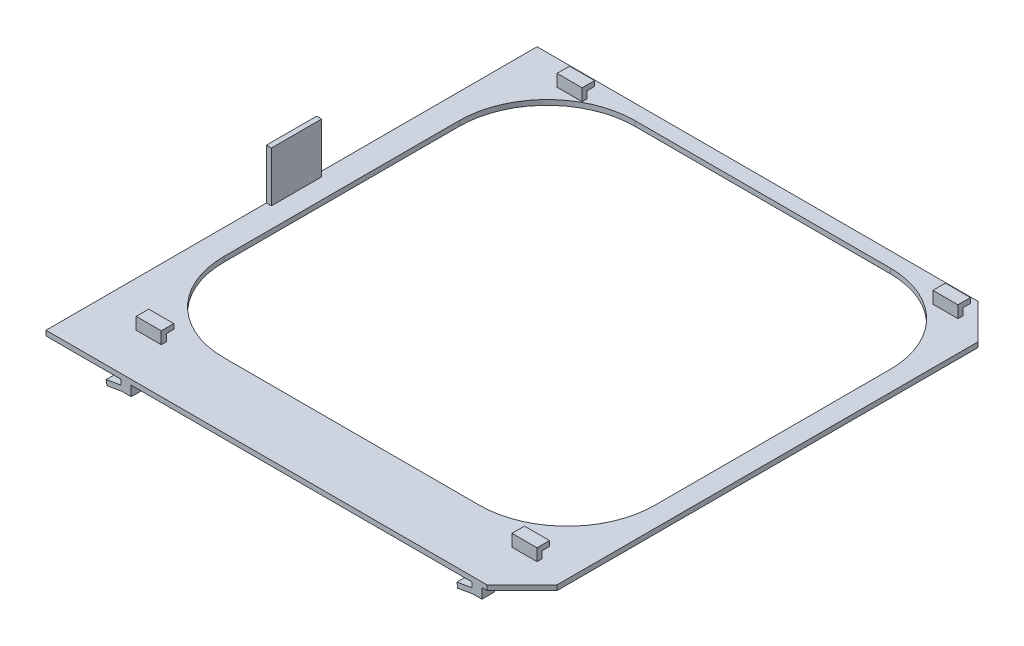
ISO-10303-21;
HEADER;
FILE_DESCRIPTION(('STEP AP214'),'2;1');
FILE_NAME('part.step','',(''),(''),'','','');
FILE_SCHEMA(('AUTOMOTIVE_DESIGN { 1 0 10303 214 1 1 1 1 }'));
ENDSEC;
DATA;
#1=APPLICATION_CONTEXT('core data for automotive mechanical design processes');
#2=APPLICATION_PROTOCOL_DEFINITION('international standard','automotive_design',2000,#1);
#3=PRODUCT_CONTEXT('',#1,'mechanical');
#4=PRODUCT('Part','Part','',(#3));
#5=PRODUCT_RELATED_PRODUCT_CATEGORY('part','',(#4));
#6=PRODUCT_DEFINITION_FORMATION('','',#4);
#7=PRODUCT_DEFINITION_CONTEXT('part definition',#1,'design');
#8=PRODUCT_DEFINITION('design','',#6,#7);
#9=PRODUCT_DEFINITION_SHAPE('','',#8);
#10=(LENGTH_UNIT() NAMED_UNIT(*) SI_UNIT(.MILLI.,.METRE.));
#11=(NAMED_UNIT(*) PLANE_ANGLE_UNIT() SI_UNIT($,.RADIAN.));
#12=(NAMED_UNIT(*) SI_UNIT($,.STERADIAN.) SOLID_ANGLE_UNIT());
#13=UNCERTAINTY_MEASURE_WITH_UNIT(LENGTH_MEASURE(1.E-05),#10,'distance_accuracy_value','');
#14=(GEOMETRIC_REPRESENTATION_CONTEXT(3) GLOBAL_UNCERTAINTY_ASSIGNED_CONTEXT((#13)) GLOBAL_UNIT_ASSIGNED_CONTEXT((#10,
#11,#12)) REPRESENTATION_CONTEXT('',''));
#15=CARTESIAN_POINT('',(0.,0.,0.));
#16=DIRECTION('',(0.,0.,1.));
#17=DIRECTION('',(1.,0.,0.));
#18=AXIS2_PLACEMENT_3D('',#15,#16,#17);
#19=CARTESIAN_POINT('',(-67.31,-16.256,-238.76));
#20=DIRECTION('',(0.,0.,1.));
#21=DIRECTION('',(1.,0.,0.));
#22=AXIS2_PLACEMENT_3D('',#19,#20,#21);
#23=PLANE('',#22);
#24=DIRECTION('',(0.,-1.,0.));
#25=VECTOR('',#24,1.);
#26=CARTESIAN_POINT('',(156.21,-16.256,-238.76));
#27=LINE('',#26,#25);
#28=CARTESIAN_POINT('',(156.21,-13.716,-238.76));
#29=VERTEX_POINT('',#28);
#30=CARTESIAN_POINT('',(156.21,-16.256,-238.76));
#31=VERTEX_POINT('',#30);
#32=EDGE_CURVE('E781',#29,#31,#27,.T.);
#33=ORIENTED_EDGE('',*,*,#32,.T.);
#34=DIRECTION('',(1.,0.,0.));
#35=VECTOR('',#34,1.);
#36=CARTESIAN_POINT('',(-67.31,-16.256,-238.76));
#37=LINE('',#36,#35);
#38=CARTESIAN_POINT('',(-67.31,-16.256,-238.76));
#39=VERTEX_POINT('',#38);
#40=EDGE_CURVE('E744',#39,#31,#37,.T.);
#41=ORIENTED_EDGE('',*,*,#40,.F.);
#42=DIRECTION('',(0.,1.,0.));
#43=VECTOR('',#42,1.);
#44=CARTESIAN_POINT('',(-67.31,-16.256,-238.76));
#45=LINE('',#44,#43);
#46=CARTESIAN_POINT('',(-67.31,-13.716,-238.76));
#47=VERTEX_POINT('',#46);
#48=EDGE_CURVE('E755',#39,#47,#45,.T.);
#49=ORIENTED_EDGE('',*,*,#48,.T.);
#50=DIRECTION('',(1.,0.,0.));
#51=VECTOR('',#50,1.);
#52=CARTESIAN_POINT('',(-67.31,-13.716,-238.76));
#53=LINE('',#52,#51);
#54=EDGE_CURVE('E743',#47,#29,#53,.T.);
#55=ORIENTED_EDGE('',*,*,#54,.T.);
#56=EDGE_LOOP('',(#33,#41,#49,#55));
#57=FACE_BOUND('',#56,.T.);
#58=ADVANCED_FACE('F34',(#57),#23,.F.);
#59=CARTESIAN_POINT('',(149.031066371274,-21.297411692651,10.1600000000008));
#60=DIRECTION('',(-0.173648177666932,0.984807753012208,0.));
#61=DIRECTION('',(-0.984807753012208,-0.173648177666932,0.));
#62=AXIS2_PLACEMENT_3D('',#59,#60,#61);
#63=PLANE('',#62);
#64=DIRECTION('',(-0.984807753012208,-0.173648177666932,0.));
#65=VECTOR('',#64,1.);
#66=CARTESIAN_POINT('',(149.031066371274,-21.297411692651,3.80999999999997));
#67=LINE('',#66,#65);
#68=CARTESIAN_POINT('',(148.812221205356,-21.336,3.80999999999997));
#69=VERTEX_POINT('',#68);
#70=CARTESIAN_POINT('',(141.411066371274,-22.6410232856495,3.80999999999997));
#71=VERTEX_POINT('',#70);
#72=EDGE_CURVE('E50',#69,#71,#67,.T.);
#73=ORIENTED_EDGE('',*,*,#72,.F.);
#74=DIRECTION('',(0.,0.,1.));
#75=VECTOR('',#74,1.);
#76=CARTESIAN_POINT('',(148.812221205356,-21.336,0.));
#77=LINE('',#76,#75);
#78=CARTESIAN_POINT('',(148.812221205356,-21.336,10.1599999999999));
#79=VERTEX_POINT('',#78);
#80=EDGE_CURVE('E429',#69,#79,#77,.T.);
#81=ORIENTED_EDGE('',*,*,#80,.T.);
#82=DIRECTION('',(0.984807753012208,0.173648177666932,0.));
#83=VECTOR('',#82,1.);
#84=CARTESIAN_POINT('',(149.031066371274,-21.297411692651,10.1600000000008));
#85=LINE('',#84,#83);
#86=CARTESIAN_POINT('',(141.411066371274,-22.6410232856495,10.1600000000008));
#87=VERTEX_POINT('',#86);
#88=EDGE_CURVE('E417',#87,#79,#85,.T.);
#89=ORIENTED_EDGE('',*,*,#88,.F.);
#90=DIRECTION('',(0.,0.,-1.));
#91=VECTOR('',#90,1.);
#92=CARTESIAN_POINT('',(141.411066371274,-22.6410232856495,10.1600000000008));
#93=LINE('',#92,#91);
#94=EDGE_CURVE('E423',#87,#71,#93,.T.);
#95=ORIENTED_EDGE('',*,*,#94,.T.);
#96=EDGE_LOOP('',(#73,#81,#89,#95));
#97=FACE_BOUND('',#96,.T.);
#98=ADVANCED_FACE('F872',(#97),#63,.F.);
#99=CARTESIAN_POINT('',(148.59,-18.796,10.1600000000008));
#100=DIRECTION('',(0.173648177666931,-0.984807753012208,0.));
#101=DIRECTION('',(0.984807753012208,0.173648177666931,0.));
#102=AXIS2_PLACEMENT_3D('',#99,#100,#101);
#103=PLANE('',#102);
#104=DIRECTION('',(0.984807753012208,0.173648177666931,0.));
#105=VECTOR('',#104,1.);
#106=CARTESIAN_POINT('',(148.59,-18.796,3.80999999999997));
#107=LINE('',#106,#105);
#108=CARTESIAN_POINT('',(140.97,-20.1396115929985,3.80999999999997));
#109=VERTEX_POINT('',#108);
#110=CARTESIAN_POINT('',(148.59,-18.796,3.80999999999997));
#111=VERTEX_POINT('',#110);
#112=EDGE_CURVE('E825',#109,#111,#107,.T.);
#113=ORIENTED_EDGE('',*,*,#112,.F.);
#114=DIRECTION('',(0.,0.,-1.));
#115=VECTOR('',#114,1.);
#116=CARTESIAN_POINT('',(140.97,-20.1396115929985,10.1600000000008));
#117=LINE('',#116,#115);
#118=CARTESIAN_POINT('',(140.97,-20.1396115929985,10.1600000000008));
#119=VERTEX_POINT('',#118);
#120=EDGE_CURVE('E426',#119,#109,#117,.T.);
#121=ORIENTED_EDGE('',*,*,#120,.F.);
#122=DIRECTION('',(-0.984807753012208,-0.173648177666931,0.));
#123=VECTOR('',#122,1.);
#124=CARTESIAN_POINT('',(148.59,-18.796,10.1600000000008));
#125=LINE('',#124,#123);
#126=CARTESIAN_POINT('',(148.59,-18.796,10.1599999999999));
#127=VERTEX_POINT('',#126);
#128=EDGE_CURVE('E408',#127,#119,#125,.T.);
#129=ORIENTED_EDGE('',*,*,#128,.F.);
#130=DIRECTION('',(0.,0.,-1.));
#131=VECTOR('',#130,1.);
#132=CARTESIAN_POINT('',(148.59,-18.796,10.1600000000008));
#133=LINE('',#132,#131);
#134=EDGE_CURVE('E420',#127,#111,#133,.T.);
#135=ORIENTED_EDGE('',*,*,#134,.T.);
#136=EDGE_LOOP('',(#113,#121,#129,#135));
#137=FACE_BOUND('',#136,.T.);
#138=ADVANCED_FACE('F878',(#137),#103,.F.);
#139=CARTESIAN_POINT('',(140.97,-20.1396115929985,10.1600000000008));
#140=DIRECTION('',(0.984807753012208,0.17364817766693,0.));
#141=DIRECTION('',(-0.17364817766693,0.984807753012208,0.));
#142=AXIS2_PLACEMENT_3D('',#139,#140,#141);
#143=PLANE('',#142);
#144=DIRECTION('',(-0.17364817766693,0.984807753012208,0.));
#145=VECTOR('',#144,1.);
#146=CARTESIAN_POINT('',(140.97,-20.1396115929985,3.80999999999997));
#147=LINE('',#146,#145);
#148=EDGE_CURVE('E827',#71,#109,#147,.T.);
#149=ORIENTED_EDGE('',*,*,#148,.F.);
#150=ORIENTED_EDGE('',*,*,#94,.F.);
#151=DIRECTION('',(0.17364817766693,-0.984807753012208,0.));
#152=VECTOR('',#151,1.);
#153=CARTESIAN_POINT('',(140.97,-20.1396115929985,10.1600000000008));
#154=LINE('',#153,#152);
#155=EDGE_CURVE('E415',#119,#87,#154,.T.);
#156=ORIENTED_EDGE('',*,*,#155,.F.);
#157=ORIENTED_EDGE('',*,*,#120,.T.);
#158=EDGE_LOOP('',(#149,#150,#156,#157));
#159=FACE_BOUND('',#158,.T.);
#160=ADVANCED_FACE('F924',(#159),#143,.F.);
#161=CARTESIAN_POINT('',(-28.768933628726,-21.297411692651,10.1600000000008));
#162=DIRECTION('',(-0.173648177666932,0.984807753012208,0.));
#163=DIRECTION('',(-0.984807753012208,-0.173648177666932,0.));
#164=AXIS2_PLACEMENT_3D('',#161,#162,#163);
#165=PLANE('',#164);
#166=DIRECTION('',(-0.984807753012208,-0.173648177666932,0.));
#167=VECTOR('',#166,1.);
#168=CARTESIAN_POINT('',(-28.768933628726,-21.297411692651,3.80999999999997));
#169=LINE('',#168,#167);
#170=CARTESIAN_POINT('',(-28.9877787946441,-21.336,3.80999999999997));
#171=VERTEX_POINT('',#170);
#172=CARTESIAN_POINT('',(-36.388933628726,-22.6410232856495,3.80999999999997));
#173=VERTEX_POINT('',#172);
#174=EDGE_CURVE('E57',#171,#173,#169,.T.);
#175=ORIENTED_EDGE('',*,*,#174,.F.);
#176=DIRECTION('',(0.,0.,1.));
#177=VECTOR('',#176,1.);
#178=CARTESIAN_POINT('',(-28.9877787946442,-21.336,0.));
#179=LINE('',#178,#177);
#180=CARTESIAN_POINT('',(-28.9877787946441,-21.336,10.1599999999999));
#181=VERTEX_POINT('',#180);
#182=EDGE_CURVE('E404',#171,#181,#179,.T.);
#183=ORIENTED_EDGE('',*,*,#182,.T.);
#184=DIRECTION('',(0.984807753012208,0.173648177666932,0.));
#185=VECTOR('',#184,1.);
#186=CARTESIAN_POINT('',(-28.768933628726,-21.297411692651,10.1600000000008));
#187=LINE('',#186,#185);
#188=CARTESIAN_POINT('',(-36.388933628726,-22.6410232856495,10.1600000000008));
#189=VERTEX_POINT('',#188);
#190=EDGE_CURVE('E818',#189,#181,#187,.T.);
#191=ORIENTED_EDGE('',*,*,#190,.F.);
#192=DIRECTION('',(0.,0.,-1.));
#193=VECTOR('',#192,1.);
#194=CARTESIAN_POINT('',(-36.388933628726,-22.6410232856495,10.1600000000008));
#195=LINE('',#194,#193);
#196=EDGE_CURVE('E405',#189,#173,#195,.T.);
#197=ORIENTED_EDGE('',*,*,#196,.T.);
#198=EDGE_LOOP('',(#175,#183,#191,#197));
#199=FACE_BOUND('',#198,.T.);
#200=ADVANCED_FACE('F1188',(#199),#165,.F.);
#201=CARTESIAN_POINT('',(-29.21,-18.796,10.1600000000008));
#202=DIRECTION('',(0.173648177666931,-0.984807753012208,0.));
#203=DIRECTION('',(0.984807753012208,0.173648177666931,0.));
#204=AXIS2_PLACEMENT_3D('',#201,#202,#203);
#205=PLANE('',#204);
#206=DIRECTION('',(0.984807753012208,0.173648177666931,0.));
#207=VECTOR('',#206,1.);
#208=CARTESIAN_POINT('',(-29.21,-18.796,3.80999999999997));
#209=LINE('',#208,#207);
#210=CARTESIAN_POINT('',(-36.83,-20.1396115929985,3.80999999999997));
#211=VERTEX_POINT('',#210);
#212=CARTESIAN_POINT('',(-29.21,-18.796,3.80999999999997));
#213=VERTEX_POINT('',#212);
#214=EDGE_CURVE('E386',#211,#213,#209,.T.);
#215=ORIENTED_EDGE('',*,*,#214,.F.);
#216=DIRECTION('',(0.,0.,-1.));
#217=VECTOR('',#216,1.);
#218=CARTESIAN_POINT('',(-36.83,-20.1396115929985,10.1600000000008));
#219=LINE('',#218,#217);
#220=CARTESIAN_POINT('',(-36.83,-20.1396115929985,10.1600000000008));
#221=VERTEX_POINT('',#220);
#222=EDGE_CURVE('E397',#221,#211,#219,.T.);
#223=ORIENTED_EDGE('',*,*,#222,.F.);
#224=DIRECTION('',(-0.984807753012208,-0.173648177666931,0.));
#225=VECTOR('',#224,1.);
#226=CARTESIAN_POINT('',(-29.21,-18.796,10.1600000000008));
#227=LINE('',#226,#225);
#228=CARTESIAN_POINT('',(-29.21,-18.796,10.1599999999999));
#229=VERTEX_POINT('',#228);
#230=EDGE_CURVE('E822',#229,#221,#227,.T.);
#231=ORIENTED_EDGE('',*,*,#230,.F.);
#232=DIRECTION('',(0.,0.,-1.));
#233=VECTOR('',#232,1.);
#234=CARTESIAN_POINT('',(-29.21,-18.796,10.1600000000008));
#235=LINE('',#234,#233);
#236=EDGE_CURVE('E398',#229,#213,#235,.T.);
#237=ORIENTED_EDGE('',*,*,#236,.T.);
#238=EDGE_LOOP('',(#215,#223,#231,#237));
#239=FACE_BOUND('',#238,.T.);
#240=ADVANCED_FACE('F395',(#239),#205,.F.);
#241=CARTESIAN_POINT('',(-36.83,-20.1396115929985,10.1600000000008));
#242=DIRECTION('',(0.984807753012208,0.173648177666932,0.));
#243=DIRECTION('',(-0.173648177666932,0.984807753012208,0.));
#244=AXIS2_PLACEMENT_3D('',#241,#242,#243);
#245=PLANE('',#244);
#246=DIRECTION('',(-0.173648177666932,0.984807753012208,0.));
#247=VECTOR('',#246,1.);
#248=CARTESIAN_POINT('',(-36.83,-20.1396115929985,3.80999999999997));
#249=LINE('',#248,#247);
#250=EDGE_CURVE('E11',#173,#211,#249,.T.);
#251=ORIENTED_EDGE('',*,*,#250,.F.);
#252=ORIENTED_EDGE('',*,*,#196,.F.);
#253=DIRECTION('',(0.173648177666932,-0.984807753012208,0.));
#254=VECTOR('',#253,1.);
#255=CARTESIAN_POINT('',(-36.83,-20.1396115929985,10.1600000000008));
#256=LINE('',#255,#254);
#257=EDGE_CURVE('E402',#221,#189,#256,.T.);
#258=ORIENTED_EDGE('',*,*,#257,.F.);
#259=ORIENTED_EDGE('',*,*,#222,.T.);
#260=EDGE_LOOP('',(#251,#252,#258,#259));
#261=FACE_BOUND('',#260,.T.);
#262=ADVANCED_FACE('F401',(#261),#245,.F.);
#263=CARTESIAN_POINT('',(-29.21,-21.336,10.1599999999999));
#264=DIRECTION('',(1.,0.,0.));
#265=DIRECTION('',(0.,0.,-1.));
#266=AXIS2_PLACEMENT_3D('',#263,#264,#265);
#267=PLANE('',#266);
#268=ORIENTED_EDGE('',*,*,#236,.F.);
#269=DIRECTION('',(0.,1.,0.));
#270=VECTOR('',#269,1.);
#271=CARTESIAN_POINT('',(-29.21,-21.336,10.1599999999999));
#272=LINE('',#271,#270);
#273=CARTESIAN_POINT('',(-29.21,-16.256,10.1599999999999));
#274=VERTEX_POINT('',#273);
#275=EDGE_CURVE('E479',#229,#274,#272,.T.);
#276=ORIENTED_EDGE('',*,*,#275,.T.);
#277=DIRECTION('',(0.,0.,-1.));
#278=VECTOR('',#277,1.);
#279=CARTESIAN_POINT('',(-29.21,-16.256,10.1599999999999));
#280=LINE('',#279,#278);
#281=CARTESIAN_POINT('',(-29.21,-16.256,3.80999999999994));
#282=VERTEX_POINT('',#281);
#283=EDGE_CURVE('E470',#274,#282,#280,.T.);
#284=ORIENTED_EDGE('',*,*,#283,.T.);
#285=DIRECTION('',(0.,1.,0.));
#286=VECTOR('',#285,1.);
#287=CARTESIAN_POINT('',(-29.21,-21.336,3.80999999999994));
#288=LINE('',#287,#286);
#289=EDGE_CURVE('E477',#213,#282,#288,.T.);
#290=ORIENTED_EDGE('',*,*,#289,.F.);
#291=EDGE_LOOP('',(#268,#276,#284,#290));
#292=FACE_BOUND('',#291,.T.);
#293=ADVANCED_FACE('F817',(#292),#267,.F.);
#294=CARTESIAN_POINT('',(-24.13,-21.336,3.80999999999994));
#295=DIRECTION('',(0.,0.,1.));
#296=DIRECTION('',(1.,0.,0.));
#297=AXIS2_PLACEMENT_3D('',#294,#295,#296);
#298=PLANE('',#297);
#299=DIRECTION('',(1.,0.,0.));
#300=VECTOR('',#299,1.);
#301=CARTESIAN_POINT('',(-24.13,-21.336,3.80999999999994));
#302=LINE('',#301,#300);
#303=CARTESIAN_POINT('',(-24.13,-21.336,3.80999999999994));
#304=VERTEX_POINT('',#303);
#305=EDGE_CURVE('E465',#171,#304,#302,.T.);
#306=ORIENTED_EDGE('',*,*,#305,.F.);
#307=ORIENTED_EDGE('',*,*,#174,.T.);
#308=ORIENTED_EDGE('',*,*,#250,.T.);
#309=ORIENTED_EDGE('',*,*,#214,.T.);
#310=ORIENTED_EDGE('',*,*,#289,.T.);
#311=DIRECTION('',(1.,0.,0.));
#312=VECTOR('',#311,1.);
#313=CARTESIAN_POINT('',(-24.13,-16.256,3.80999999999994));
#314=LINE('',#313,#312);
#315=CARTESIAN_POINT('',(-24.13,-16.256,3.80999999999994));
#316=VERTEX_POINT('',#315);
#317=EDGE_CURVE('E463',#282,#316,#314,.T.);
#318=ORIENTED_EDGE('',*,*,#317,.T.);
#319=DIRECTION('',(0.,1.,0.));
#320=VECTOR('',#319,1.);
#321=CARTESIAN_POINT('',(-24.13,-21.336,3.80999999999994));
#322=LINE('',#321,#320);
#323=EDGE_CURVE('E467',#304,#316,#322,.T.);
#324=ORIENTED_EDGE('',*,*,#323,.F.);
#325=EDGE_LOOP('',(#306,#307,#308,#309,#310,#318,#324));
#326=FACE_BOUND('',#325,.T.);
#327=ADVANCED_FACE('F385',(#326),#298,.F.);
#328=CARTESIAN_POINT('',(0.,-21.336,0.));
#329=DIRECTION('',(0.,1.,0.));
#330=DIRECTION('',(0.,0.,1.));
#331=AXIS2_PLACEMENT_3D('',#328,#329,#330);
#332=PLANE('',#331);
#333=ORIENTED_EDGE('',*,*,#182,.F.);
#334=ORIENTED_EDGE('',*,*,#305,.T.);
#335=DIRECTION('',(0.,0.,1.));
#336=VECTOR('',#335,1.);
#337=CARTESIAN_POINT('',(-24.13,-21.336,10.1599999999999));
#338=LINE('',#337,#336);
#339=CARTESIAN_POINT('',(-24.13,-21.336,10.1599999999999));
#340=VERTEX_POINT('',#339);
#341=EDGE_CURVE('E459',#304,#340,#338,.T.);
#342=ORIENTED_EDGE('',*,*,#341,.T.);
#343=DIRECTION('',(-1.,0.,0.));
#344=VECTOR('',#343,1.);
#345=CARTESIAN_POINT('',(-24.13,-21.336,10.1599999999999));
#346=LINE('',#345,#344);
#347=EDGE_CURVE('E462',#340,#181,#346,.T.);
#348=ORIENTED_EDGE('',*,*,#347,.T.);
#349=EDGE_LOOP('',(#333,#334,#342,#348));
#350=FACE_BOUND('',#349,.T.);
#351=ADVANCED_FACE('F945',(#350),#332,.F.);
#352=CARTESIAN_POINT('',(148.59,-21.336,10.1599999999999));
#353=DIRECTION('',(1.,0.,0.));
#354=DIRECTION('',(0.,0.,-1.));
#355=AXIS2_PLACEMENT_3D('',#352,#353,#354);
#356=PLANE('',#355);
#357=ORIENTED_EDGE('',*,*,#134,.F.);
#358=DIRECTION('',(0.,1.,0.));
#359=VECTOR('',#358,1.);
#360=CARTESIAN_POINT('',(148.59,-21.336,10.1599999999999));
#361=LINE('',#360,#359);
#362=CARTESIAN_POINT('',(148.59,-16.256,10.1599999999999));
#363=VERTEX_POINT('',#362);
#364=EDGE_CURVE('E504',#127,#363,#361,.T.);
#365=ORIENTED_EDGE('',*,*,#364,.T.);
#366=DIRECTION('',(0.,0.,-1.));
#367=VECTOR('',#366,1.);
#368=CARTESIAN_POINT('',(148.59,-16.256,10.1599999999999));
#369=LINE('',#368,#367);
#370=CARTESIAN_POINT('',(148.59,-16.256,3.80999999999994));
#371=VERTEX_POINT('',#370);
#372=EDGE_CURVE('E496',#363,#371,#369,.T.);
#373=ORIENTED_EDGE('',*,*,#372,.T.);
#374=DIRECTION('',(0.,1.,0.));
#375=VECTOR('',#374,1.);
#376=CARTESIAN_POINT('',(148.59,-21.336,3.80999999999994));
#377=LINE('',#376,#375);
#378=EDGE_CURVE('E502',#111,#371,#377,.T.);
#379=ORIENTED_EDGE('',*,*,#378,.F.);
#380=EDGE_LOOP('',(#357,#365,#373,#379));
#381=FACE_BOUND('',#380,.T.);
#382=ADVANCED_FACE('F917',(#381),#356,.F.);
#383=CARTESIAN_POINT('',(153.67,-21.336,3.80999999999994));
#384=DIRECTION('',(0.,0.,1.));
#385=DIRECTION('',(1.,0.,0.));
#386=AXIS2_PLACEMENT_3D('',#383,#384,#385);
#387=PLANE('',#386);
#388=DIRECTION('',(1.,0.,0.));
#389=VECTOR('',#388,1.);
#390=CARTESIAN_POINT('',(153.67,-16.256,3.80999999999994));
#391=LINE('',#390,#389);
#392=CARTESIAN_POINT('',(153.67,-16.256,3.80999999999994));
#393=VERTEX_POINT('',#392);
#394=EDGE_CURVE('E489',#371,#393,#391,.T.);
#395=ORIENTED_EDGE('',*,*,#394,.T.);
#396=DIRECTION('',(0.,1.,0.));
#397=VECTOR('',#396,1.);
#398=CARTESIAN_POINT('',(153.67,-21.336,3.80999999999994));
#399=LINE('',#398,#397);
#400=CARTESIAN_POINT('',(153.67,-21.336,3.80999999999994));
#401=VERTEX_POINT('',#400);
#402=EDGE_CURVE('E493',#401,#393,#399,.T.);
#403=ORIENTED_EDGE('',*,*,#402,.F.);
#404=DIRECTION('',(1.,0.,0.));
#405=VECTOR('',#404,1.);
#406=CARTESIAN_POINT('',(153.67,-21.336,3.80999999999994));
#407=LINE('',#406,#405);
#408=EDGE_CURVE('E491',#69,#401,#407,.T.);
#409=ORIENTED_EDGE('',*,*,#408,.F.);
#410=ORIENTED_EDGE('',*,*,#72,.T.);
#411=ORIENTED_EDGE('',*,*,#148,.T.);
#412=ORIENTED_EDGE('',*,*,#112,.T.);
#413=ORIENTED_EDGE('',*,*,#378,.T.);
#414=EDGE_LOOP('',(#395,#403,#409,#410,#411,#412,#413));
#415=FACE_BOUND('',#414,.T.);
#416=ADVANCED_FACE('F912',(#415),#387,.F.);
#417=CARTESIAN_POINT('',(0.,-21.336,0.));
#418=DIRECTION('',(0.,1.,0.));
#419=DIRECTION('',(0.,0.,1.));
#420=AXIS2_PLACEMENT_3D('',#417,#418,#419);
#421=PLANE('',#420);
#422=ORIENTED_EDGE('',*,*,#80,.F.);
#423=ORIENTED_EDGE('',*,*,#408,.T.);
#424=DIRECTION('',(0.,0.,1.));
#425=VECTOR('',#424,1.);
#426=CARTESIAN_POINT('',(153.67,-21.336,10.1599999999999));
#427=LINE('',#426,#425);
#428=CARTESIAN_POINT('',(153.67,-21.336,10.1599999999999));
#429=VERTEX_POINT('',#428);
#430=EDGE_CURVE('E485',#401,#429,#427,.T.);
#431=ORIENTED_EDGE('',*,*,#430,.T.);
#432=DIRECTION('',(-1.,0.,0.));
#433=VECTOR('',#432,1.);
#434=CARTESIAN_POINT('',(153.67,-21.336,10.1599999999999));
#435=LINE('',#434,#433);
#436=EDGE_CURVE('E488',#429,#79,#435,.T.);
#437=ORIENTED_EDGE('',*,*,#436,.T.);
#438=EDGE_LOOP('',(#422,#423,#431,#437));
#439=FACE_BOUND('',#438,.T.);
#440=ADVANCED_FACE('F929',(#439),#421,.F.);
#441=CARTESIAN_POINT('',(0.,-13.716,0.));
#442=DIRECTION('',(0.,-1.,0.));
#443=DIRECTION('',(0.,0.,-1.));
#444=AXIS2_PLACEMENT_3D('',#441,#442,#443);
#445=PLANE('',#444);
#446=DIRECTION('',(0.,0.,1.));
#447=VECTOR('',#446,1.);
#448=CARTESIAN_POINT('',(158.75,-13.716,-226.06));
#449=LINE('',#448,#447);
#450=CARTESIAN_POINT('',(158.75,-13.716,-228.6));
#451=VERTEX_POINT('',#450);
#452=CARTESIAN_POINT('',(158.75,-13.716,-226.06));
#453=VERTEX_POINT('',#452);
#454=EDGE_CURVE('E623',#451,#453,#449,.T.);
#455=ORIENTED_EDGE('',*,*,#454,.T.);
#456=DIRECTION('',(-1.,0.,0.));
#457=VECTOR('',#456,1.);
#458=CARTESIAN_POINT('',(158.75,-13.716,-226.06));
#459=LINE('',#458,#457);
#460=CARTESIAN_POINT('',(146.05,-13.716,-226.06));
#461=VERTEX_POINT('',#460);
#462=EDGE_CURVE('E625',#453,#461,#459,.T.);
#463=ORIENTED_EDGE('',*,*,#462,.T.);
#464=DIRECTION('',(0.,0.,-1.));
#465=VECTOR('',#464,1.);
#466=CARTESIAN_POINT('',(146.05,-13.716,-226.06));
#467=LINE('',#466,#465);
#468=CARTESIAN_POINT('',(146.05,-13.716,-228.6));
#469=VERTEX_POINT('',#468);
#470=EDGE_CURVE('E627',#461,#469,#467,.T.);
#471=ORIENTED_EDGE('',*,*,#470,.T.);
#472=DIRECTION('',(1.,0.,0.));
#473=VECTOR('',#472,1.);
#474=CARTESIAN_POINT('',(158.75,-13.716,-228.6));
#475=LINE('',#474,#473);
#476=EDGE_CURVE('E629',#469,#451,#475,.T.);
#477=ORIENTED_EDGE('',*,*,#476,.T.);
#478=EDGE_LOOP('',(#455,#463,#471,#477));
#479=FACE_BOUND('',#478,.T.);
#480=DIRECTION('',(0.,0.,-1.));
#481=VECTOR('',#480,1.);
#482=CARTESIAN_POINT('',(-44.45,-13.716,-12.7));
#483=LINE('',#482,#481);
#484=CARTESIAN_POINT('',(-44.45,-13.716,-12.7));
#485=VERTEX_POINT('',#484);
#486=CARTESIAN_POINT('',(-44.45,-13.716,-15.24));
#487=VERTEX_POINT('',#486);
#488=EDGE_CURVE('E665',#485,#487,#483,.T.);
#489=ORIENTED_EDGE('',*,*,#488,.T.);
#490=DIRECTION('',(1.,0.,0.));
#491=VECTOR('',#490,1.);
#492=CARTESIAN_POINT('',(-44.45,-13.716,-15.24));
#493=LINE('',#492,#491);
#494=CARTESIAN_POINT('',(-31.75,-13.716,-15.24));
#495=VERTEX_POINT('',#494);
#496=EDGE_CURVE('E667',#487,#495,#493,.T.);
#497=ORIENTED_EDGE('',*,*,#496,.T.);
#498=DIRECTION('',(0.,0.,1.));
#499=VECTOR('',#498,1.);
#500=CARTESIAN_POINT('',(-31.75,-13.716,-12.7));
#501=LINE('',#500,#499);
#502=CARTESIAN_POINT('',(-31.75,-13.716,-12.7));
#503=VERTEX_POINT('',#502);
#504=EDGE_CURVE('E669',#495,#503,#501,.T.);
#505=ORIENTED_EDGE('',*,*,#504,.T.);
#506=DIRECTION('',(-1.,0.,0.));
#507=VECTOR('',#506,1.);
#508=CARTESIAN_POINT('',(-44.45,-13.716,-12.7));
#509=LINE('',#508,#507);
#510=EDGE_CURVE('E671',#503,#485,#509,.T.);
#511=ORIENTED_EDGE('',*,*,#510,.T.);
#512=EDGE_LOOP('',(#489,#497,#505,#511));
#513=FACE_BOUND('',#512,.T.);
#514=CARTESIAN_POINT('',(-10.16,-13.716,-67.31));
#515=DIRECTION('',(0.,-1.,0.));
#516=DIRECTION('',(0.,0.,-1.));
#517=AXIS2_PLACEMENT_3D('',#514,#515,#516);
#518=CIRCLE('',#517,44.45);
#519=CARTESIAN_POINT('',(-10.16,-13.716,-22.86));
#520=VERTEX_POINT('',#519);
#521=CARTESIAN_POINT('',(-54.61,-13.716,-67.31));
#522=VERTEX_POINT('',#521);
#523=EDGE_CURVE('E685',#520,#522,#518,.T.);
#524=ORIENTED_EDGE('',*,*,#523,.T.);
#525=DIRECTION('',(0.,0.,-1.));
#526=VECTOR('',#525,1.);
#527=CARTESIAN_POINT('',(-54.61,-13.716,-186.69));
#528=LINE('',#527,#526);
#529=CARTESIAN_POINT('',(-54.61,-13.716,-186.69));
#530=VERTEX_POINT('',#529);
#531=EDGE_CURVE('E706',#522,#530,#528,.T.);
#532=ORIENTED_EDGE('',*,*,#531,.T.);
#533=CARTESIAN_POINT('',(-10.16,-13.716,-186.69));
#534=DIRECTION('',(0.,-1.,0.));
#535=DIRECTION('',(0.,0.,-1.));
#536=AXIS2_PLACEMENT_3D('',#533,#534,#535);
#537=CIRCLE('',#536,44.45);
#538=CARTESIAN_POINT('',(-10.16,-13.716,-231.14));
#539=VERTEX_POINT('',#538);
#540=EDGE_CURVE('E709',#530,#539,#537,.T.);
#541=ORIENTED_EDGE('',*,*,#540,.T.);
#542=DIRECTION('',(1.,0.,0.));
#543=VECTOR('',#542,1.);
#544=CARTESIAN_POINT('',(119.38,-13.716,-231.14));
#545=LINE('',#544,#543);
#546=CARTESIAN_POINT('',(119.38,-13.716,-231.14));
#547=VERTEX_POINT('',#546);
#548=EDGE_CURVE('E712',#539,#547,#545,.T.);
#549=ORIENTED_EDGE('',*,*,#548,.T.);
#550=CARTESIAN_POINT('',(119.38,-13.716,-186.69));
#551=DIRECTION('',(0.,-1.,0.));
#552=DIRECTION('',(0.,0.,1.));
#553=AXIS2_PLACEMENT_3D('',#550,#551,#552);
#554=CIRCLE('',#553,44.45);
#555=CARTESIAN_POINT('',(163.83,-13.716,-186.69));
#556=VERTEX_POINT('',#555);
#557=EDGE_CURVE('E715',#547,#556,#554,.T.);
#558=ORIENTED_EDGE('',*,*,#557,.T.);
#559=DIRECTION('',(0.,0.,1.));
#560=VECTOR('',#559,1.);
#561=CARTESIAN_POINT('',(163.83,-13.716,-186.69));
#562=LINE('',#561,#560);
#563=CARTESIAN_POINT('',(163.83,-13.716,-67.31));
#564=VERTEX_POINT('',#563);
#565=EDGE_CURVE('E718',#556,#564,#562,.T.);
#566=ORIENTED_EDGE('',*,*,#565,.T.);
#567=CARTESIAN_POINT('',(119.38,-13.716,-67.31));
#568=DIRECTION('',(0.,-1.,0.));
#569=DIRECTION('',(0.,0.,-1.));
#570=AXIS2_PLACEMENT_3D('',#567,#568,#569);
#571=CIRCLE('',#570,44.45);
#572=CARTESIAN_POINT('',(119.38,-13.716,-22.86));
#573=VERTEX_POINT('',#572);
#574=EDGE_CURVE('E721',#564,#573,#571,.T.);
#575=ORIENTED_EDGE('',*,*,#574,.T.);
#576=DIRECTION('',(-1.,0.,0.));
#577=VECTOR('',#576,1.);
#578=CARTESIAN_POINT('',(119.38,-13.716,-22.86));
#579=LINE('',#578,#577);
#580=EDGE_CURVE('E689',#573,#520,#579,.T.);
#581=ORIENTED_EDGE('',*,*,#580,.T.);
#582=EDGE_LOOP('',(#524,#532,#541,#549,#558,#566,#575,#581));
#583=FACE_BOUND('',#582,.T.);
#584=DIRECTION('',(0.,0.,-1.));
#585=VECTOR('',#584,1.);
#586=CARTESIAN_POINT('',(146.05,-13.716,-12.7));
#587=LINE('',#586,#585);
#588=CARTESIAN_POINT('',(146.05,-13.716,-12.7));
#589=VERTEX_POINT('',#588);
#590=CARTESIAN_POINT('',(146.05,-13.716,-15.24));
#591=VERTEX_POINT('',#590);
#592=EDGE_CURVE('E644',#589,#591,#587,.T.);
#593=ORIENTED_EDGE('',*,*,#592,.T.);
#594=DIRECTION('',(1.,0.,0.));
#595=VECTOR('',#594,1.);
#596=CARTESIAN_POINT('',(146.05,-13.716,-15.24));
#597=LINE('',#596,#595);
#598=CARTESIAN_POINT('',(158.75,-13.716,-15.24));
#599=VERTEX_POINT('',#598);
#600=EDGE_CURVE('E646',#591,#599,#597,.T.);
#601=ORIENTED_EDGE('',*,*,#600,.T.);
#602=DIRECTION('',(0.,0.,1.));
#603=VECTOR('',#602,1.);
#604=CARTESIAN_POINT('',(158.75,-13.716,-12.7));
#605=LINE('',#604,#603);
#606=CARTESIAN_POINT('',(158.75,-13.716,-12.7));
#607=VERTEX_POINT('',#606);
#608=EDGE_CURVE('E648',#599,#607,#605,.T.);
#609=ORIENTED_EDGE('',*,*,#608,.T.);
#610=DIRECTION('',(-1.,0.,0.));
#611=VECTOR('',#610,1.);
#612=CARTESIAN_POINT('',(146.05,-13.716,-12.7));
#613=LINE('',#612,#611);
#614=EDGE_CURVE('E650',#607,#589,#613,.T.);
#615=ORIENTED_EDGE('',*,*,#614,.T.);
#616=EDGE_LOOP('',(#593,#601,#609,#615));
#617=FACE_BOUND('',#616,.T.);
#618=DIRECTION('',(0.,0.,1.));
#619=VECTOR('',#618,1.);
#620=CARTESIAN_POINT('',(-31.75,-13.716,-226.06));
#621=LINE('',#620,#619);
#622=CARTESIAN_POINT('',(-31.75,-13.716,-228.6));
#623=VERTEX_POINT('',#622);
#624=CARTESIAN_POINT('',(-31.75,-13.716,-226.06));
#625=VERTEX_POINT('',#624);
#626=EDGE_CURVE('E602',#623,#625,#621,.T.);
#627=ORIENTED_EDGE('',*,*,#626,.T.);
#628=DIRECTION('',(-1.,0.,0.));
#629=VECTOR('',#628,1.);
#630=CARTESIAN_POINT('',(-31.75,-13.716,-226.06));
#631=LINE('',#630,#629);
#632=CARTESIAN_POINT('',(-44.45,-13.716,-226.06));
#633=VERTEX_POINT('',#632);
#634=EDGE_CURVE('E604',#625,#633,#631,.T.);
#635=ORIENTED_EDGE('',*,*,#634,.T.);
#636=DIRECTION('',(0.,0.,-1.));
#637=VECTOR('',#636,1.);
#638=CARTESIAN_POINT('',(-44.45,-13.716,-226.06));
#639=LINE('',#638,#637);
#640=CARTESIAN_POINT('',(-44.45,-13.716,-228.6));
#641=VERTEX_POINT('',#640);
#642=EDGE_CURVE('E606',#633,#641,#639,.T.);
#643=ORIENTED_EDGE('',*,*,#642,.T.);
#644=DIRECTION('',(1.,0.,0.));
#645=VECTOR('',#644,1.);
#646=CARTESIAN_POINT('',(-31.75,-13.716,-228.6));
#647=LINE('',#646,#645);
#648=EDGE_CURVE('E608',#641,#623,#647,.T.);
#649=ORIENTED_EDGE('',*,*,#648,.T.);
#650=EDGE_LOOP('',(#627,#635,#643,#649));
#651=FACE_BOUND('',#650,.T.);
#652=DIRECTION('',(1.,0.,0.));
#653=VECTOR('',#652,1.);
#654=CARTESIAN_POINT('',(-67.31,-13.716,-101.6));
#655=LINE('',#654,#653);
#656=CARTESIAN_POINT('',(-67.31,-13.716,-101.6));
#657=VERTEX_POINT('',#656);
#658=CARTESIAN_POINT('',(-64.77,-13.716,-101.6));
#659=VERTEX_POINT('',#658);
#660=EDGE_CURVE('E432',#657,#659,#655,.T.);
#661=ORIENTED_EDGE('',*,*,#660,.F.);
#662=DIRECTION('',(0.,0.,-1.));
#663=VECTOR('',#662,1.);
#664=CARTESIAN_POINT('',(-67.31,-13.716,10.1599999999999));
#665=LINE('',#664,#663);
#666=CARTESIAN_POINT('',(-67.31,-13.716,10.1599999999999));
#667=VERTEX_POINT('',#666);
#668=EDGE_CURVE('E747',#667,#657,#665,.T.);
#669=ORIENTED_EDGE('',*,*,#668,.F.);
#670=DIRECTION('',(-1.,0.,0.));
#671=VECTOR('',#670,1.);
#672=CARTESIAN_POINT('',(-67.31,-13.716,10.1599999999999));
#673=LINE('',#672,#671);
#674=CARTESIAN_POINT('',(156.21,-13.716,10.1599999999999));
#675=VERTEX_POINT('',#674);
#676=EDGE_CURVE('E761',#675,#667,#673,.T.);
#677=ORIENTED_EDGE('',*,*,#676,.F.);
#678=DIRECTION('',(-0.707106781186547,0.,0.707106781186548));
#679=VECTOR('',#678,1.);
#680=CARTESIAN_POINT('',(156.21,-13.716,10.1599999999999));
#681=LINE('',#680,#679);
#682=CARTESIAN_POINT('',(173.99,-13.716,-7.62000000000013));
#683=VERTEX_POINT('',#682);
#684=EDGE_CURVE('E777',#675,#683,#681,.F.);
#685=ORIENTED_EDGE('',*,*,#684,.T.);
#686=DIRECTION('',(0.,0.,1.));
#687=VECTOR('',#686,1.);
#688=CARTESIAN_POINT('',(173.99,-13.716,-238.76));
#689=LINE('',#688,#687);
#690=CARTESIAN_POINT('',(173.99,-13.716,-220.98));
#691=VERTEX_POINT('',#690);
#692=EDGE_CURVE('E758',#691,#683,#689,.T.);
#693=ORIENTED_EDGE('',*,*,#692,.F.);
#694=DIRECTION('',(0.707106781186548,0.,0.707106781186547));
#695=VECTOR('',#694,1.);
#696=CARTESIAN_POINT('',(173.99,-13.716,-220.98));
#697=LINE('',#696,#695);
#698=EDGE_CURVE('E779',#691,#29,#697,.F.);
#699=ORIENTED_EDGE('',*,*,#698,.T.);
#700=ORIENTED_EDGE('',*,*,#54,.F.);
#701=CARTESIAN_POINT('',(-67.31,-13.716,-127.));
#702=VERTEX_POINT('',#701);
#703=EDGE_CURVE('E763',#702,#47,#665,.T.);
#704=ORIENTED_EDGE('',*,*,#703,.F.);
#705=DIRECTION('',(-1.,0.,0.));
#706=VECTOR('',#705,1.);
#707=CARTESIAN_POINT('',(-67.31,-13.716,-127.));
#708=LINE('',#707,#706);
#709=CARTESIAN_POINT('',(-64.77,-13.716,-127.));
#710=VERTEX_POINT('',#709);
#711=EDGE_CURVE('E437',#710,#702,#708,.T.);
#712=ORIENTED_EDGE('',*,*,#711,.F.);
#713=DIRECTION('',(0.,0.,-1.));
#714=VECTOR('',#713,1.);
#715=CARTESIAN_POINT('',(-64.77,-13.716,-127.));
#716=LINE('',#715,#714);
#717=EDGE_CURVE('E445',#659,#710,#716,.T.);
#718=ORIENTED_EDGE('',*,*,#717,.F.);
#719=EDGE_LOOP('',(#661,#669,#677,#685,#693,#699,#700,#704,#712,#718));
#720=FACE_BOUND('',#719,.T.);
#721=ADVANCED_FACE('F800',(#479,#513,#583,#617,#651,#720),#445,.F.);
#722=CARTESIAN_POINT('',(0.,-16.256,0.));
#723=DIRECTION('',(0.,-1.,0.));
#724=DIRECTION('',(0.,0.,-1.));
#725=AXIS2_PLACEMENT_3D('',#722,#723,#724);
#726=PLANE('',#725);
#727=CARTESIAN_POINT('',(137.382221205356,-16.256,-236.728));
#728=DIRECTION('',(0.,-1.,0.));
#729=DIRECTION('',(0.,0.,-1.));
#730=AXIS2_PLACEMENT_3D('',#727,#728,#729);
#731=CIRCLE('',#730,1.01599999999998);
#732=CARTESIAN_POINT('',(137.382221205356,-16.256,-237.744));
#733=VERTEX_POINT('',#732);
#734=EDGE_CURVE('E836',#733,#733,#731,.T.);
#735=ORIENTED_EDGE('',*,*,#734,.F.);
#736=EDGE_LOOP('',(#735));
#737=FACE_BOUND('',#736,.T.);
#738=CARTESIAN_POINT('',(-40.4177787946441,-16.256,-236.728));
#739=DIRECTION('',(0.,-1.,0.));
#740=DIRECTION('',(0.,0.,-1.));
#741=AXIS2_PLACEMENT_3D('',#738,#739,#740);
#742=CIRCLE('',#741,1.01600000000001);
#743=CARTESIAN_POINT('',(-40.4177787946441,-16.256,-237.744));
#744=VERTEX_POINT('',#743);
#745=EDGE_CURVE('E830',#744,#744,#742,.T.);
#746=ORIENTED_EDGE('',*,*,#745,.F.);
#747=EDGE_LOOP('',(#746));
#748=FACE_BOUND('',#747,.T.);
#749=ORIENTED_EDGE('',*,*,#40,.T.);
#750=DIRECTION('',(-0.707106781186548,0.,-0.707106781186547));
#751=VECTOR('',#750,1.);
#752=CARTESIAN_POINT('',(197.485,-16.256,-197.485));
#753=LINE('',#752,#751);
#754=CARTESIAN_POINT('',(173.99,-16.256,-220.98));
#755=VERTEX_POINT('',#754);
#756=EDGE_CURVE('E786',#31,#755,#753,.F.);
#757=ORIENTED_EDGE('',*,*,#756,.T.);
#758=DIRECTION('',(0.,0.,1.));
#759=VECTOR('',#758,1.);
#760=CARTESIAN_POINT('',(173.99,-16.256,-238.76));
#761=LINE('',#760,#759);
#762=CARTESIAN_POINT('',(173.99,-16.256,-7.62000000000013));
#763=VERTEX_POINT('',#762);
#764=EDGE_CURVE('E746',#755,#763,#761,.T.);
#765=ORIENTED_EDGE('',*,*,#764,.T.);
#766=DIRECTION('',(0.707106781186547,0.,-0.707106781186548));
#767=VECTOR('',#766,1.);
#768=CARTESIAN_POINT('',(83.185,-16.256,83.1849999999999));
#769=LINE('',#768,#767);
#770=CARTESIAN_POINT('',(156.21,-16.256,10.1599999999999));
#771=VERTEX_POINT('',#770);
#772=EDGE_CURVE('E784',#763,#771,#769,.F.);
#773=ORIENTED_EDGE('',*,*,#772,.T.);
#774=DIRECTION('',(-1.,0.,0.));
#775=VECTOR('',#774,1.);
#776=CARTESIAN_POINT('',(-67.31,-16.256,10.1599999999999));
#777=LINE('',#776,#775);
#778=CARTESIAN_POINT('',(153.67,-16.256,10.1599999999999));
#779=VERTEX_POINT('',#778);
#780=EDGE_CURVE('E750',#771,#779,#777,.T.);
#781=ORIENTED_EDGE('',*,*,#780,.T.);
#782=DIRECTION('',(0.,0.,1.));
#783=VECTOR('',#782,1.);
#784=CARTESIAN_POINT('',(153.67,-16.256,10.1599999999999));
#785=LINE('',#784,#783);
#786=EDGE_CURVE('E484',#393,#779,#785,.T.);
#787=ORIENTED_EDGE('',*,*,#786,.F.);
#788=ORIENTED_EDGE('',*,*,#394,.F.);
#789=ORIENTED_EDGE('',*,*,#372,.F.);
#790=CARTESIAN_POINT('',(-24.13,-16.256,10.1599999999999));
#791=VERTEX_POINT('',#790);
#792=EDGE_CURVE('E753',#363,#791,#777,.T.);
#793=ORIENTED_EDGE('',*,*,#792,.T.);
#794=DIRECTION('',(0.,0.,1.));
#795=VECTOR('',#794,1.);
#796=CARTESIAN_POINT('',(-24.13,-16.256,10.1599999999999));
#797=LINE('',#796,#795);
#798=EDGE_CURVE('E458',#316,#791,#797,.T.);
#799=ORIENTED_EDGE('',*,*,#798,.F.);
#800=ORIENTED_EDGE('',*,*,#317,.F.);
#801=ORIENTED_EDGE('',*,*,#283,.F.);
#802=CARTESIAN_POINT('',(-67.31,-16.256,10.1599999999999));
#803=VERTEX_POINT('',#802);
#804=EDGE_CURVE('E749',#274,#803,#777,.T.);
#805=ORIENTED_EDGE('',*,*,#804,.T.);
#806=DIRECTION('',(0.,0.,-1.));
#807=VECTOR('',#806,1.);
#808=CARTESIAN_POINT('',(-67.31,-16.256,10.1599999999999));
#809=LINE('',#808,#807);
#810=EDGE_CURVE('E752',#803,#39,#809,.T.);
#811=ORIENTED_EDGE('',*,*,#810,.T.);
#812=EDGE_LOOP('',(#749,#757,#765,#773,#781,#787,#788,#789,#793,#799,#800,#801,#805,#811));
#813=FACE_BOUND('',#812,.T.);
#814=DIRECTION('',(1.,0.,0.));
#815=VECTOR('',#814,1.);
#816=CARTESIAN_POINT('',(119.38,-16.256,-231.14));
#817=LINE('',#816,#815);
#818=CARTESIAN_POINT('',(-10.16,-16.256,-231.14));
#819=VERTEX_POINT('',#818);
#820=CARTESIAN_POINT('',(119.38,-16.256,-231.14));
#821=VERTEX_POINT('',#820);
#822=EDGE_CURVE('E693',#819,#821,#817,.T.);
#823=ORIENTED_EDGE('',*,*,#822,.F.);
#824=CARTESIAN_POINT('',(-10.16,-16.256,-186.69));
#825=DIRECTION('',(0.,-1.,0.));
#826=DIRECTION('',(0.,0.,-1.));
#827=AXIS2_PLACEMENT_3D('',#824,#825,#826);
#828=CIRCLE('',#827,44.45);
#829=CARTESIAN_POINT('',(-54.61,-16.256,-186.69));
#830=VERTEX_POINT('',#829);
#831=EDGE_CURVE('E691',#830,#819,#828,.T.);
#832=ORIENTED_EDGE('',*,*,#831,.F.);
#833=DIRECTION('',(0.,0.,-1.));
#834=VECTOR('',#833,1.);
#835=CARTESIAN_POINT('',(-54.61,-16.256,-186.69));
#836=LINE('',#835,#834);
#837=CARTESIAN_POINT('',(-54.61,-16.256,-67.31));
#838=VERTEX_POINT('',#837);
#839=EDGE_CURVE('E688',#838,#830,#836,.T.);
#840=ORIENTED_EDGE('',*,*,#839,.F.);
#841=CARTESIAN_POINT('',(-10.16,-16.256,-67.31));
#842=DIRECTION('',(0.,-1.,0.));
#843=DIRECTION('',(0.,0.,-1.));
#844=AXIS2_PLACEMENT_3D('',#841,#842,#843);
#845=CIRCLE('',#844,44.45);
#846=CARTESIAN_POINT('',(-10.16,-16.256,-22.86));
#847=VERTEX_POINT('',#846);
#848=EDGE_CURVE('E686',#847,#838,#845,.T.);
#849=ORIENTED_EDGE('',*,*,#848,.F.);
#850=DIRECTION('',(-1.,0.,0.));
#851=VECTOR('',#850,1.);
#852=CARTESIAN_POINT('',(119.38,-16.256,-22.86));
#853=LINE('',#852,#851);
#854=CARTESIAN_POINT('',(119.38,-16.256,-22.86));
#855=VERTEX_POINT('',#854);
#856=EDGE_CURVE('E701',#855,#847,#853,.T.);
#857=ORIENTED_EDGE('',*,*,#856,.F.);
#858=CARTESIAN_POINT('',(119.38,-16.256,-67.31));
#859=DIRECTION('',(0.,-1.,0.));
#860=DIRECTION('',(0.,0.,-1.));
#861=AXIS2_PLACEMENT_3D('',#858,#859,#860);
#862=CIRCLE('',#861,44.45);
#863=CARTESIAN_POINT('',(163.83,-16.256,-67.31));
#864=VERTEX_POINT('',#863);
#865=EDGE_CURVE('E699',#864,#855,#862,.T.);
#866=ORIENTED_EDGE('',*,*,#865,.F.);
#867=DIRECTION('',(0.,0.,1.));
#868=VECTOR('',#867,1.);
#869=CARTESIAN_POINT('',(163.83,-16.256,-186.69));
#870=LINE('',#869,#868);
#871=CARTESIAN_POINT('',(163.83,-16.256,-186.69));
#872=VERTEX_POINT('',#871);
#873=EDGE_CURVE('E697',#872,#864,#870,.T.);
#874=ORIENTED_EDGE('',*,*,#873,.F.);
#875=CARTESIAN_POINT('',(119.38,-16.256,-186.69));
#876=DIRECTION('',(0.,-1.,0.));
#877=DIRECTION('',(0.,0.,1.));
#878=AXIS2_PLACEMENT_3D('',#875,#876,#877);
#879=CIRCLE('',#878,44.45);
#880=EDGE_CURVE('E695',#821,#872,#879,.T.);
#881=ORIENTED_EDGE('',*,*,#880,.F.);
#882=EDGE_LOOP('',(#823,#832,#840,#849,#857,#866,#874,#881));
#883=FACE_BOUND('',#882,.T.);
#884=ADVANCED_FACE('F814',(#737,#748,#813,#883),#726,.T.);
#885=CARTESIAN_POINT('',(173.99,-16.256,-238.76));
#886=DIRECTION('',(-1.,0.,0.));
#887=DIRECTION('',(0.,0.,1.));
#888=AXIS2_PLACEMENT_3D('',#885,#886,#887);
#889=PLANE('',#888);
#890=ORIENTED_EDGE('',*,*,#764,.F.);
#891=DIRECTION('',(0.,1.,0.));
#892=VECTOR('',#891,1.);
#893=CARTESIAN_POINT('',(173.99,-16.256,-220.98));
#894=LINE('',#893,#892);
#895=EDGE_CURVE('E774',#755,#691,#894,.T.);
#896=ORIENTED_EDGE('',*,*,#895,.T.);
#897=ORIENTED_EDGE('',*,*,#692,.T.);
#898=DIRECTION('',(0.,-1.,0.));
#899=VECTOR('',#898,1.);
#900=CARTESIAN_POINT('',(173.99,-16.256,-7.62000000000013));
#901=LINE('',#900,#899);
#902=EDGE_CURVE('E771',#683,#763,#901,.T.);
#903=ORIENTED_EDGE('',*,*,#902,.T.);
#904=EDGE_LOOP('',(#890,#896,#897,#903));
#905=FACE_BOUND('',#904,.T.);
#906=ADVANCED_FACE('F882',(#905),#889,.F.);
#907=CARTESIAN_POINT('',(-67.31,-16.256,10.1599999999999));
#908=DIRECTION('',(0.,0.,-1.));
#909=DIRECTION('',(-1.,0.,0.));
#910=AXIS2_PLACEMENT_3D('',#907,#908,#909);
#911=PLANE('',#910);
#912=ORIENTED_EDGE('',*,*,#190,.T.);
#913=ORIENTED_EDGE('',*,*,#347,.F.);
#914=DIRECTION('',(0.,1.,0.));
#915=VECTOR('',#914,1.);
#916=CARTESIAN_POINT('',(-24.13,-21.336,10.1599999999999));
#917=LINE('',#916,#915);
#918=EDGE_CURVE('E481',#340,#791,#917,.T.);
#919=ORIENTED_EDGE('',*,*,#918,.T.);
#920=ORIENTED_EDGE('',*,*,#792,.F.);
#921=ORIENTED_EDGE('',*,*,#364,.F.);
#922=ORIENTED_EDGE('',*,*,#128,.T.);
#923=ORIENTED_EDGE('',*,*,#155,.T.);
#924=ORIENTED_EDGE('',*,*,#88,.T.);
#925=ORIENTED_EDGE('',*,*,#436,.F.);
#926=DIRECTION('',(0.,1.,0.));
#927=VECTOR('',#926,1.);
#928=CARTESIAN_POINT('',(153.67,-21.336,10.1599999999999));
#929=LINE('',#928,#927);
#930=EDGE_CURVE('E506',#429,#779,#929,.T.);
#931=ORIENTED_EDGE('',*,*,#930,.T.);
#932=ORIENTED_EDGE('',*,*,#780,.F.);
#933=DIRECTION('',(0.,1.,0.));
#934=VECTOR('',#933,1.);
#935=CARTESIAN_POINT('',(156.21,-16.256,10.1599999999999));
#936=LINE('',#935,#934);
#937=EDGE_CURVE('E43',#771,#675,#936,.T.);
#938=ORIENTED_EDGE('',*,*,#937,.T.);
#939=ORIENTED_EDGE('',*,*,#676,.T.);
#940=DIRECTION('',(0.,1.,0.));
#941=VECTOR('',#940,1.);
#942=CARTESIAN_POINT('',(-67.31,-16.256,10.1599999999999));
#943=LINE('',#942,#941);
#944=EDGE_CURVE('E768',#803,#667,#943,.T.);
#945=ORIENTED_EDGE('',*,*,#944,.F.);
#946=ORIENTED_EDGE('',*,*,#804,.F.);
#947=ORIENTED_EDGE('',*,*,#275,.F.);
#948=ORIENTED_EDGE('',*,*,#230,.T.);
#949=ORIENTED_EDGE('',*,*,#257,.T.);
#950=EDGE_LOOP('',(#912,#913,#919,#920,#921,#922,#923,#924,#925,#931,#932,#938,#939,#945,#946,
#947,#948,#949));
#951=FACE_BOUND('',#950,.T.);
#952=ADVANCED_FACE('F793',(#951),#911,.F.);
#953=CARTESIAN_POINT('',(-67.31,-16.256,10.1599999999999));
#954=DIRECTION('',(1.,0.,0.));
#955=DIRECTION('',(0.,0.,-1.));
#956=AXIS2_PLACEMENT_3D('',#953,#954,#955);
#957=PLANE('',#956);
#958=ORIENTED_EDGE('',*,*,#668,.T.);
#959=DIRECTION('',(0.,-1.,0.));
#960=VECTOR('',#959,1.);
#961=CARTESIAN_POINT('',(-67.31,11.684,-101.6));
#962=LINE('',#961,#960);
#963=CARTESIAN_POINT('',(-67.31,11.684,-101.6));
#964=VERTEX_POINT('',#963);
#965=EDGE_CURVE('E456',#964,#657,#962,.T.);
#966=ORIENTED_EDGE('',*,*,#965,.F.);
#967=DIRECTION('',(0.,0.,1.));
#968=VECTOR('',#967,1.);
#969=CARTESIAN_POINT('',(-67.31,11.684,-127.));
#970=LINE('',#969,#968);
#971=CARTESIAN_POINT('',(-67.31,11.684,-127.));
#972=VERTEX_POINT('',#971);
#973=EDGE_CURVE('E433',#972,#964,#970,.T.);
#974=ORIENTED_EDGE('',*,*,#973,.F.);
#975=DIRECTION('',(0.,-1.,0.));
#976=VECTOR('',#975,1.);
#977=CARTESIAN_POINT('',(-67.31,11.684,-127.));
#978=LINE('',#977,#976);
#979=EDGE_CURVE('E443',#972,#702,#978,.T.);
#980=ORIENTED_EDGE('',*,*,#979,.T.);
#981=ORIENTED_EDGE('',*,*,#703,.T.);
#982=ORIENTED_EDGE('',*,*,#48,.F.);
#983=ORIENTED_EDGE('',*,*,#810,.F.);
#984=ORIENTED_EDGE('',*,*,#944,.T.);
#985=EDGE_LOOP('',(#958,#966,#974,#980,#981,#982,#983,#984));
#986=FACE_BOUND('',#985,.T.);
#987=ADVANCED_FACE('F805',(#986),#957,.F.);
#988=CARTESIAN_POINT('',(-10.16,-16.256,-67.31));
#989=DIRECTION('',(0.,1.,0.));
#990=DIRECTION('',(0.,0.,1.));
#991=AXIS2_PLACEMENT_3D('',#988,#989,#990);
#992=CYLINDRICAL_SURFACE('',#991,44.45);
#993=ORIENTED_EDGE('',*,*,#523,.F.);
#994=DIRECTION('',(0.,1.,0.));
#995=VECTOR('',#994,1.);
#996=CARTESIAN_POINT('',(-10.16,-16.256,-22.86));
#997=LINE('',#996,#995);
#998=EDGE_CURVE('E703',#847,#520,#997,.T.);
#999=ORIENTED_EDGE('',*,*,#998,.F.);
#1000=ORIENTED_EDGE('',*,*,#848,.T.);
#1001=DIRECTION('',(0.,1.,0.));
#1002=VECTOR('',#1001,1.);
#1003=CARTESIAN_POINT('',(-54.61,-16.256,-67.31));
#1004=LINE('',#1003,#1002);
#1005=EDGE_CURVE('E740',#838,#522,#1004,.T.);
#1006=ORIENTED_EDGE('',*,*,#1005,.T.);
#1007=EDGE_LOOP('',(#993,#999,#1000,#1006));
#1008=FACE_BOUND('',#1007,.T.);
#1009=ADVANCED_FACE('F1082',(#1008),#992,.F.);
#1010=CARTESIAN_POINT('',(-54.61,-16.256,-186.69));
#1011=DIRECTION('',(1.,0.,0.));
#1012=DIRECTION('',(0.,0.,-1.));
#1013=AXIS2_PLACEMENT_3D('',#1010,#1011,#1012);
#1014=PLANE('',#1013);
#1015=ORIENTED_EDGE('',*,*,#531,.F.);
#1016=ORIENTED_EDGE('',*,*,#1005,.F.);
#1017=ORIENTED_EDGE('',*,*,#839,.T.);
#1018=DIRECTION('',(0.,1.,0.));
#1019=VECTOR('',#1018,1.);
#1020=CARTESIAN_POINT('',(-54.61,-16.256,-186.69));
#1021=LINE('',#1020,#1019);
#1022=EDGE_CURVE('E738',#830,#530,#1021,.T.);
#1023=ORIENTED_EDGE('',*,*,#1022,.T.);
#1024=EDGE_LOOP('',(#1015,#1016,#1017,#1023));
#1025=FACE_BOUND('',#1024,.T.);
#1026=ADVANCED_FACE('F1078',(#1025),#1014,.T.);
#1027=CARTESIAN_POINT('',(-10.16,-16.256,-186.69));
#1028=DIRECTION('',(0.,1.,0.));
#1029=DIRECTION('',(0.,0.,1.));
#1030=AXIS2_PLACEMENT_3D('',#1027,#1028,#1029);
#1031=CYLINDRICAL_SURFACE('',#1030,44.45);
#1032=ORIENTED_EDGE('',*,*,#540,.F.);
#1033=ORIENTED_EDGE('',*,*,#1022,.F.);
#1034=ORIENTED_EDGE('',*,*,#831,.T.);
#1035=DIRECTION('',(0.,1.,0.));
#1036=VECTOR('',#1035,1.);
#1037=CARTESIAN_POINT('',(-10.16,-16.256,-231.14));
#1038=LINE('',#1037,#1036);
#1039=EDGE_CURVE('E736',#819,#539,#1038,.T.);
#1040=ORIENTED_EDGE('',*,*,#1039,.T.);
#1041=EDGE_LOOP('',(#1032,#1033,#1034,#1040));
#1042=FACE_BOUND('',#1041,.T.);
#1043=ADVANCED_FACE('F1074',(#1042),#1031,.F.);
#1044=CARTESIAN_POINT('',(119.38,-16.256,-231.14));
#1045=DIRECTION('',(0.,0.,1.));
#1046=DIRECTION('',(1.,0.,0.));
#1047=AXIS2_PLACEMENT_3D('',#1044,#1045,#1046);
#1048=PLANE('',#1047);
#1049=ORIENTED_EDGE('',*,*,#548,.F.);
#1050=ORIENTED_EDGE('',*,*,#1039,.F.);
#1051=ORIENTED_EDGE('',*,*,#822,.T.);
#1052=DIRECTION('',(0.,1.,0.));
#1053=VECTOR('',#1052,1.);
#1054=CARTESIAN_POINT('',(119.38,-16.256,-231.14));
#1055=LINE('',#1054,#1053);
#1056=EDGE_CURVE('E734',#821,#547,#1055,.T.);
#1057=ORIENTED_EDGE('',*,*,#1056,.T.);
#1058=EDGE_LOOP('',(#1049,#1050,#1051,#1057));
#1059=FACE_BOUND('',#1058,.T.);
#1060=ADVANCED_FACE('F1070',(#1059),#1048,.T.);
#1061=CARTESIAN_POINT('',(119.38,-16.256,-186.69));
#1062=DIRECTION('',(0.,1.,0.));
#1063=DIRECTION('',(0.,0.,1.));
#1064=AXIS2_PLACEMENT_3D('',#1061,#1062,#1063);
#1065=CYLINDRICAL_SURFACE('',#1064,44.45);
#1066=ORIENTED_EDGE('',*,*,#557,.F.);
#1067=ORIENTED_EDGE('',*,*,#1056,.F.);
#1068=ORIENTED_EDGE('',*,*,#880,.T.);
#1069=DIRECTION('',(0.,1.,0.));
#1070=VECTOR('',#1069,1.);
#1071=CARTESIAN_POINT('',(163.83,-16.256,-186.69));
#1072=LINE('',#1071,#1070);
#1073=EDGE_CURVE('E732',#872,#556,#1072,.T.);
#1074=ORIENTED_EDGE('',*,*,#1073,.T.);
#1075=EDGE_LOOP('',(#1066,#1067,#1068,#1074));
#1076=FACE_BOUND('',#1075,.T.);
#1077=ADVANCED_FACE('F1066',(#1076),#1065,.F.);
#1078=CARTESIAN_POINT('',(163.83,-16.256,-186.69));
#1079=DIRECTION('',(-1.,0.,0.));
#1080=DIRECTION('',(0.,0.,1.));
#1081=AXIS2_PLACEMENT_3D('',#1078,#1079,#1080);
#1082=PLANE('',#1081);
#1083=ORIENTED_EDGE('',*,*,#565,.F.);
#1084=ORIENTED_EDGE('',*,*,#1073,.F.);
#1085=ORIENTED_EDGE('',*,*,#873,.T.);
#1086=DIRECTION('',(0.,1.,0.));
#1087=VECTOR('',#1086,1.);
#1088=CARTESIAN_POINT('',(163.83,-16.256,-67.31));
#1089=LINE('',#1088,#1087);
#1090=EDGE_CURVE('E730',#864,#564,#1089,.T.);
#1091=ORIENTED_EDGE('',*,*,#1090,.T.);
#1092=EDGE_LOOP('',(#1083,#1084,#1085,#1091));
#1093=FACE_BOUND('',#1092,.T.);
#1094=ADVANCED_FACE('F1062',(#1093),#1082,.T.);
#1095=CARTESIAN_POINT('',(119.38,-16.256,-67.31));
#1096=DIRECTION('',(0.,1.,0.));
#1097=DIRECTION('',(0.,0.,1.));
#1098=AXIS2_PLACEMENT_3D('',#1095,#1096,#1097);
#1099=CYLINDRICAL_SURFACE('',#1098,44.45);
#1100=ORIENTED_EDGE('',*,*,#574,.F.);
#1101=ORIENTED_EDGE('',*,*,#1090,.F.);
#1102=ORIENTED_EDGE('',*,*,#865,.T.);
#1103=DIRECTION('',(0.,1.,0.));
#1104=VECTOR('',#1103,1.);
#1105=CARTESIAN_POINT('',(119.38,-16.256,-22.86));
#1106=LINE('',#1105,#1104);
#1107=EDGE_CURVE('E728',#855,#573,#1106,.T.);
#1108=ORIENTED_EDGE('',*,*,#1107,.T.);
#1109=EDGE_LOOP('',(#1100,#1101,#1102,#1108));
#1110=FACE_BOUND('',#1109,.T.);
#1111=ADVANCED_FACE('F1058',(#1110),#1099,.F.);
#1112=CARTESIAN_POINT('',(119.38,-16.256,-22.86));
#1113=DIRECTION('',(0.,0.,-1.));
#1114=DIRECTION('',(-1.,0.,0.));
#1115=AXIS2_PLACEMENT_3D('',#1112,#1113,#1114);
#1116=PLANE('',#1115);
#1117=ORIENTED_EDGE('',*,*,#580,.F.);
#1118=ORIENTED_EDGE('',*,*,#1107,.F.);
#1119=ORIENTED_EDGE('',*,*,#856,.T.);
#1120=ORIENTED_EDGE('',*,*,#998,.T.);
#1121=EDGE_LOOP('',(#1117,#1118,#1119,#1120));
#1122=FACE_BOUND('',#1121,.T.);
#1123=ADVANCED_FACE('F1054',(#1122),#1116,.T.);
#1124=CARTESIAN_POINT('',(-44.45,-13.716,-12.7));
#1125=DIRECTION('',(1.,0.,0.));
#1126=DIRECTION('',(0.,0.,-1.));
#1127=AXIS2_PLACEMENT_3D('',#1124,#1125,#1126);
#1128=PLANE('',#1127);
#1129=DIRECTION('',(0.,1.,0.));
#1130=VECTOR('',#1129,1.);
#1131=CARTESIAN_POINT('',(-44.45,-13.716,-12.7));
#1132=LINE('',#1131,#1130);
#1133=CARTESIAN_POINT('',(-44.45,-7.62,-12.7));
#1134=VERTEX_POINT('',#1133);
#1135=EDGE_CURVE('E673',#485,#1134,#1132,.T.);
#1136=ORIENTED_EDGE('',*,*,#1135,.T.);
#1137=DIRECTION('',(0.,0.,1.));
#1138=VECTOR('',#1137,1.);
#1139=CARTESIAN_POINT('',(-44.45,-7.62,-12.7));
#1140=LINE('',#1139,#1138);
#1141=CARTESIAN_POINT('',(-44.45,-7.62,-19.05));
#1142=VERTEX_POINT('',#1141);
#1143=EDGE_CURVE('E510',#1142,#1134,#1140,.T.);
#1144=ORIENTED_EDGE('',*,*,#1143,.F.);
#1145=DIRECTION('',(0.,-1.,0.));
#1146=VECTOR('',#1145,1.);
#1147=CARTESIAN_POINT('',(-44.45,-7.62,-19.05));
#1148=LINE('',#1147,#1146);
#1149=CARTESIAN_POINT('',(-44.45,-10.16,-19.05));
#1150=VERTEX_POINT('',#1149);
#1151=EDGE_CURVE('E521',#1142,#1150,#1148,.T.);
#1152=ORIENTED_EDGE('',*,*,#1151,.T.);
#1153=DIRECTION('',(0.,0.,1.));
#1154=VECTOR('',#1153,1.);
#1155=CARTESIAN_POINT('',(-44.45,-10.16,-12.7));
#1156=LINE('',#1155,#1154);
#1157=CARTESIAN_POINT('',(-44.45,-10.16,-15.24));
#1158=VERTEX_POINT('',#1157);
#1159=EDGE_CURVE('E509',#1150,#1158,#1156,.T.);
#1160=ORIENTED_EDGE('',*,*,#1159,.T.);
#1161=DIRECTION('',(0.,1.,0.));
#1162=VECTOR('',#1161,1.);
#1163=CARTESIAN_POINT('',(-44.45,-13.716,-15.24));
#1164=LINE('',#1163,#1162);
#1165=EDGE_CURVE('E682',#487,#1158,#1164,.T.);
#1166=ORIENTED_EDGE('',*,*,#1165,.F.);
#1167=ORIENTED_EDGE('',*,*,#488,.F.);
#1168=EDGE_LOOP('',(#1136,#1144,#1152,#1160,#1166,#1167));
#1169=FACE_BOUND('',#1168,.T.);
#1170=ADVANCED_FACE('F1050',(#1169),#1128,.F.);
#1171=CARTESIAN_POINT('',(-44.45,-13.716,-15.24));
#1172=DIRECTION('',(0.,0.,1.));
#1173=DIRECTION('',(1.,0.,0.));
#1174=AXIS2_PLACEMENT_3D('',#1171,#1172,#1173);
#1175=PLANE('',#1174);
#1176=DIRECTION('',(1.,0.,0.));
#1177=VECTOR('',#1176,1.);
#1178=CARTESIAN_POINT('',(-44.45,-10.16,-15.24));
#1179=LINE('',#1178,#1177);
#1180=CARTESIAN_POINT('',(-31.75,-10.16,-15.24));
#1181=VERTEX_POINT('',#1180);
#1182=EDGE_CURVE('E664',#1158,#1181,#1179,.T.);
#1183=ORIENTED_EDGE('',*,*,#1182,.T.);
#1184=DIRECTION('',(0.,1.,0.));
#1185=VECTOR('',#1184,1.);
#1186=CARTESIAN_POINT('',(-31.75,-13.716,-15.24));
#1187=LINE('',#1186,#1185);
#1188=EDGE_CURVE('E679',#495,#1181,#1187,.T.);
#1189=ORIENTED_EDGE('',*,*,#1188,.F.);
#1190=ORIENTED_EDGE('',*,*,#496,.F.);
#1191=ORIENTED_EDGE('',*,*,#1165,.T.);
#1192=EDGE_LOOP('',(#1183,#1189,#1190,#1191));
#1193=FACE_BOUND('',#1192,.T.);
#1194=ADVANCED_FACE('F1046',(#1193),#1175,.F.);
#1195=CARTESIAN_POINT('',(-31.75,-13.716,-12.7));
#1196=DIRECTION('',(-1.,0.,0.));
#1197=DIRECTION('',(0.,0.,1.));
#1198=AXIS2_PLACEMENT_3D('',#1195,#1196,#1197);
#1199=PLANE('',#1198);
#1200=ORIENTED_EDGE('',*,*,#1188,.T.);
#1201=DIRECTION('',(0.,0.,-1.));
#1202=VECTOR('',#1201,1.);
#1203=CARTESIAN_POINT('',(-31.75,-10.16,-12.7));
#1204=LINE('',#1203,#1202);
#1205=CARTESIAN_POINT('',(-31.75,-10.16,-19.05));
#1206=VERTEX_POINT('',#1205);
#1207=EDGE_CURVE('E524',#1181,#1206,#1204,.T.);
#1208=ORIENTED_EDGE('',*,*,#1207,.T.);
#1209=DIRECTION('',(0.,-1.,0.));
#1210=VECTOR('',#1209,1.);
#1211=CARTESIAN_POINT('',(-31.75,-7.62,-19.05));
#1212=LINE('',#1211,#1210);
#1213=CARTESIAN_POINT('',(-31.75,-7.62,-19.05));
#1214=VERTEX_POINT('',#1213);
#1215=EDGE_CURVE('E529',#1214,#1206,#1212,.T.);
#1216=ORIENTED_EDGE('',*,*,#1215,.F.);
#1217=DIRECTION('',(0.,0.,-1.));
#1218=VECTOR('',#1217,1.);
#1219=CARTESIAN_POINT('',(-31.75,-7.62,-12.7));
#1220=LINE('',#1219,#1218);
#1221=CARTESIAN_POINT('',(-31.75,-7.62,-12.7));
#1222=VERTEX_POINT('',#1221);
#1223=EDGE_CURVE('E517',#1222,#1214,#1220,.T.);
#1224=ORIENTED_EDGE('',*,*,#1223,.F.);
#1225=DIRECTION('',(0.,1.,0.));
#1226=VECTOR('',#1225,1.);
#1227=CARTESIAN_POINT('',(-31.75,-13.716,-12.7));
#1228=LINE('',#1227,#1226);
#1229=EDGE_CURVE('E677',#503,#1222,#1228,.T.);
#1230=ORIENTED_EDGE('',*,*,#1229,.F.);
#1231=ORIENTED_EDGE('',*,*,#504,.F.);
#1232=EDGE_LOOP('',(#1200,#1208,#1216,#1224,#1230,#1231));
#1233=FACE_BOUND('',#1232,.T.);
#1234=ADVANCED_FACE('F1042',(#1233),#1199,.F.);
#1235=CARTESIAN_POINT('',(-44.45,-13.716,-12.7));
#1236=DIRECTION('',(0.,0.,-1.));
#1237=DIRECTION('',(-1.,0.,0.));
#1238=AXIS2_PLACEMENT_3D('',#1235,#1236,#1237);
#1239=PLANE('',#1238);
#1240=ORIENTED_EDGE('',*,*,#1229,.T.);
#1241=DIRECTION('',(1.,0.,0.));
#1242=VECTOR('',#1241,1.);
#1243=CARTESIAN_POINT('',(-44.45,-7.62,-12.7));
#1244=LINE('',#1243,#1242);
#1245=EDGE_CURVE('E513',#1134,#1222,#1244,.T.);
#1246=ORIENTED_EDGE('',*,*,#1245,.F.);
#1247=ORIENTED_EDGE('',*,*,#1135,.F.);
#1248=ORIENTED_EDGE('',*,*,#510,.F.);
#1249=EDGE_LOOP('',(#1240,#1246,#1247,#1248));
#1250=FACE_BOUND('',#1249,.T.);
#1251=ADVANCED_FACE('F1038',(#1250),#1239,.F.);
#1252=CARTESIAN_POINT('',(146.05,-13.716,-12.7));
#1253=DIRECTION('',(1.,0.,0.));
#1254=DIRECTION('',(0.,0.,-1.));
#1255=AXIS2_PLACEMENT_3D('',#1252,#1253,#1254);
#1256=PLANE('',#1255);
#1257=DIRECTION('',(0.,1.,0.));
#1258=VECTOR('',#1257,1.);
#1259=CARTESIAN_POINT('',(146.05,-13.716,-12.7));
#1260=LINE('',#1259,#1258);
#1261=CARTESIAN_POINT('',(146.05,-7.62,-12.7));
#1262=VERTEX_POINT('',#1261);
#1263=EDGE_CURVE('E652',#589,#1262,#1260,.T.);
#1264=ORIENTED_EDGE('',*,*,#1263,.T.);
#1265=DIRECTION('',(0.,0.,1.));
#1266=VECTOR('',#1265,1.);
#1267=CARTESIAN_POINT('',(146.05,-7.62,-12.7));
#1268=LINE('',#1267,#1266);
#1269=CARTESIAN_POINT('',(146.05,-7.62,-19.05));
#1270=VERTEX_POINT('',#1269);
#1271=EDGE_CURVE('E533',#1270,#1262,#1268,.T.);
#1272=ORIENTED_EDGE('',*,*,#1271,.F.);
#1273=DIRECTION('',(0.,-1.,0.));
#1274=VECTOR('',#1273,1.);
#1275=CARTESIAN_POINT('',(146.05,-7.62,-19.05));
#1276=LINE('',#1275,#1274);
#1277=CARTESIAN_POINT('',(146.05,-10.16,-19.05));
#1278=VERTEX_POINT('',#1277);
#1279=EDGE_CURVE('E544',#1270,#1278,#1276,.T.);
#1280=ORIENTED_EDGE('',*,*,#1279,.T.);
#1281=DIRECTION('',(0.,0.,1.));
#1282=VECTOR('',#1281,1.);
#1283=CARTESIAN_POINT('',(146.05,-10.16,-12.7));
#1284=LINE('',#1283,#1282);
#1285=CARTESIAN_POINT('',(146.05,-10.16,-15.24));
#1286=VERTEX_POINT('',#1285);
#1287=EDGE_CURVE('E532',#1278,#1286,#1284,.T.);
#1288=ORIENTED_EDGE('',*,*,#1287,.T.);
#1289=DIRECTION('',(0.,1.,0.));
#1290=VECTOR('',#1289,1.);
#1291=CARTESIAN_POINT('',(146.05,-13.716,-15.24));
#1292=LINE('',#1291,#1290);
#1293=EDGE_CURVE('E661',#591,#1286,#1292,.T.);
#1294=ORIENTED_EDGE('',*,*,#1293,.F.);
#1295=ORIENTED_EDGE('',*,*,#592,.F.);
#1296=EDGE_LOOP('',(#1264,#1272,#1280,#1288,#1294,#1295));
#1297=FACE_BOUND('',#1296,.T.);
#1298=ADVANCED_FACE('F1034',(#1297),#1256,.F.);
#1299=CARTESIAN_POINT('',(146.05,-13.716,-15.24));
#1300=DIRECTION('',(0.,0.,1.));
#1301=DIRECTION('',(1.,0.,0.));
#1302=AXIS2_PLACEMENT_3D('',#1299,#1300,#1301);
#1303=PLANE('',#1302);
#1304=DIRECTION('',(1.,0.,0.));
#1305=VECTOR('',#1304,1.);
#1306=CARTESIAN_POINT('',(146.05,-10.16,-15.24));
#1307=LINE('',#1306,#1305);
#1308=CARTESIAN_POINT('',(158.75,-10.16,-15.24));
#1309=VERTEX_POINT('',#1308);
#1310=EDGE_CURVE('E643',#1286,#1309,#1307,.T.);
#1311=ORIENTED_EDGE('',*,*,#1310,.T.);
#1312=DIRECTION('',(0.,1.,0.));
#1313=VECTOR('',#1312,1.);
#1314=CARTESIAN_POINT('',(158.75,-13.716,-15.24));
#1315=LINE('',#1314,#1313);
#1316=EDGE_CURVE('E658',#599,#1309,#1315,.T.);
#1317=ORIENTED_EDGE('',*,*,#1316,.F.);
#1318=ORIENTED_EDGE('',*,*,#600,.F.);
#1319=ORIENTED_EDGE('',*,*,#1293,.T.);
#1320=EDGE_LOOP('',(#1311,#1317,#1318,#1319));
#1321=FACE_BOUND('',#1320,.T.);
#1322=ADVANCED_FACE('F1030',(#1321),#1303,.F.);
#1323=CARTESIAN_POINT('',(158.75,-13.716,-12.7));
#1324=DIRECTION('',(-1.,0.,0.));
#1325=DIRECTION('',(0.,0.,1.));
#1326=AXIS2_PLACEMENT_3D('',#1323,#1324,#1325);
#1327=PLANE('',#1326);
#1328=ORIENTED_EDGE('',*,*,#1316,.T.);
#1329=DIRECTION('',(0.,0.,-1.));
#1330=VECTOR('',#1329,1.);
#1331=CARTESIAN_POINT('',(158.75,-10.16,-12.7));
#1332=LINE('',#1331,#1330);
#1333=CARTESIAN_POINT('',(158.75,-10.16,-19.05));
#1334=VERTEX_POINT('',#1333);
#1335=EDGE_CURVE('E547',#1309,#1334,#1332,.T.);
#1336=ORIENTED_EDGE('',*,*,#1335,.T.);
#1337=DIRECTION('',(0.,-1.,0.));
#1338=VECTOR('',#1337,1.);
#1339=CARTESIAN_POINT('',(158.75,-7.62,-19.05));
#1340=LINE('',#1339,#1338);
#1341=CARTESIAN_POINT('',(158.75,-7.62,-19.05));
#1342=VERTEX_POINT('',#1341);
#1343=EDGE_CURVE('E552',#1342,#1334,#1340,.T.);
#1344=ORIENTED_EDGE('',*,*,#1343,.F.);
#1345=DIRECTION('',(0.,0.,-1.));
#1346=VECTOR('',#1345,1.);
#1347=CARTESIAN_POINT('',(158.75,-7.62,-12.7));
#1348=LINE('',#1347,#1346);
#1349=CARTESIAN_POINT('',(158.75,-7.62,-12.7));
#1350=VERTEX_POINT('',#1349);
#1351=EDGE_CURVE('E540',#1350,#1342,#1348,.T.);
#1352=ORIENTED_EDGE('',*,*,#1351,.F.);
#1353=DIRECTION('',(0.,1.,0.));
#1354=VECTOR('',#1353,1.);
#1355=CARTESIAN_POINT('',(158.75,-13.716,-12.7));
#1356=LINE('',#1355,#1354);
#1357=EDGE_CURVE('E656',#607,#1350,#1356,.T.);
#1358=ORIENTED_EDGE('',*,*,#1357,.F.);
#1359=ORIENTED_EDGE('',*,*,#608,.F.);
#1360=EDGE_LOOP('',(#1328,#1336,#1344,#1352,#1358,#1359));
#1361=FACE_BOUND('',#1360,.T.);
#1362=ADVANCED_FACE('F1026',(#1361),#1327,.F.);
#1363=CARTESIAN_POINT('',(146.05,-13.716,-12.7));
#1364=DIRECTION('',(0.,0.,-1.));
#1365=DIRECTION('',(-1.,0.,0.));
#1366=AXIS2_PLACEMENT_3D('',#1363,#1364,#1365);
#1367=PLANE('',#1366);
#1368=ORIENTED_EDGE('',*,*,#1357,.T.);
#1369=DIRECTION('',(1.,0.,0.));
#1370=VECTOR('',#1369,1.);
#1371=CARTESIAN_POINT('',(146.05,-7.62,-12.7));
#1372=LINE('',#1371,#1370);
#1373=EDGE_CURVE('E536',#1262,#1350,#1372,.T.);
#1374=ORIENTED_EDGE('',*,*,#1373,.F.);
#1375=ORIENTED_EDGE('',*,*,#1263,.F.);
#1376=ORIENTED_EDGE('',*,*,#614,.F.);
#1377=EDGE_LOOP('',(#1368,#1374,#1375,#1376));
#1378=FACE_BOUND('',#1377,.T.);
#1379=ADVANCED_FACE('F1022',(#1378),#1367,.F.);
#1380=CARTESIAN_POINT('',(158.75,-13.716,-226.06));
#1381=DIRECTION('',(-1.,0.,0.));
#1382=DIRECTION('',(0.,0.,1.));
#1383=AXIS2_PLACEMENT_3D('',#1380,#1381,#1382);
#1384=PLANE('',#1383);
#1385=DIRECTION('',(0.,1.,0.));
#1386=VECTOR('',#1385,1.);
#1387=CARTESIAN_POINT('',(158.75,-13.716,-228.6));
#1388=LINE('',#1387,#1386);
#1389=CARTESIAN_POINT('',(158.75,-10.16,-228.6));
#1390=VERTEX_POINT('',#1389);
#1391=EDGE_CURVE('E631',#451,#1390,#1388,.T.);
#1392=ORIENTED_EDGE('',*,*,#1391,.T.);
#1393=DIRECTION('',(0.,0.,-1.));
#1394=VECTOR('',#1393,1.);
#1395=CARTESIAN_POINT('',(158.75,-10.16,-226.06));
#1396=LINE('',#1395,#1394);
#1397=CARTESIAN_POINT('',(158.75,-10.16,-232.41));
#1398=VERTEX_POINT('',#1397);
#1399=EDGE_CURVE('E570',#1390,#1398,#1396,.T.);
#1400=ORIENTED_EDGE('',*,*,#1399,.T.);
#1401=DIRECTION('',(0.,-1.,0.));
#1402=VECTOR('',#1401,1.);
#1403=CARTESIAN_POINT('',(158.75,-7.62,-232.41));
#1404=LINE('',#1403,#1402);
#1405=CARTESIAN_POINT('',(158.75,-7.62,-232.41));
#1406=VERTEX_POINT('',#1405);
#1407=EDGE_CURVE('E575',#1406,#1398,#1404,.T.);
#1408=ORIENTED_EDGE('',*,*,#1407,.F.);
#1409=DIRECTION('',(0.,0.,-1.));
#1410=VECTOR('',#1409,1.);
#1411=CARTESIAN_POINT('',(158.75,-7.62,-226.06));
#1412=LINE('',#1411,#1410);
#1413=CARTESIAN_POINT('',(158.75,-7.62,-226.06));
#1414=VERTEX_POINT('',#1413);
#1415=EDGE_CURVE('E563',#1414,#1406,#1412,.T.);
#1416=ORIENTED_EDGE('',*,*,#1415,.F.);
#1417=DIRECTION('',(0.,1.,0.));
#1418=VECTOR('',#1417,1.);
#1419=CARTESIAN_POINT('',(158.75,-13.716,-226.06));
#1420=LINE('',#1419,#1418);
#1421=EDGE_CURVE('E641',#453,#1414,#1420,.T.);
#1422=ORIENTED_EDGE('',*,*,#1421,.F.);
#1423=ORIENTED_EDGE('',*,*,#454,.F.);
#1424=EDGE_LOOP('',(#1392,#1400,#1408,#1416,#1422,#1423));
#1425=FACE_BOUND('',#1424,.T.);
#1426=ADVANCED_FACE('F1018',(#1425),#1384,.F.);
#1427=CARTESIAN_POINT('',(158.75,-13.716,-226.06));
#1428=DIRECTION('',(0.,0.,-1.));
#1429=DIRECTION('',(-1.,0.,0.));
#1430=AXIS2_PLACEMENT_3D('',#1427,#1428,#1429);
#1431=PLANE('',#1430);
#1432=ORIENTED_EDGE('',*,*,#1421,.T.);
#1433=DIRECTION('',(1.,0.,0.));
#1434=VECTOR('',#1433,1.);
#1435=CARTESIAN_POINT('',(146.05,-7.62,-226.06));
#1436=LINE('',#1435,#1434);
#1437=CARTESIAN_POINT('',(146.05,-7.62,-226.06));
#1438=VERTEX_POINT('',#1437);
#1439=EDGE_CURVE('E559',#1438,#1414,#1436,.T.);
#1440=ORIENTED_EDGE('',*,*,#1439,.F.);
#1441=DIRECTION('',(0.,1.,0.));
#1442=VECTOR('',#1441,1.);
#1443=CARTESIAN_POINT('',(146.05,-13.716,-226.06));
#1444=LINE('',#1443,#1442);
#1445=EDGE_CURVE('E639',#461,#1438,#1444,.T.);
#1446=ORIENTED_EDGE('',*,*,#1445,.F.);
#1447=ORIENTED_EDGE('',*,*,#462,.F.);
#1448=EDGE_LOOP('',(#1432,#1440,#1446,#1447));
#1449=FACE_BOUND('',#1448,.T.);
#1450=ADVANCED_FACE('F1014',(#1449),#1431,.F.);
#1451=CARTESIAN_POINT('',(146.05,-13.716,-226.06));
#1452=DIRECTION('',(1.,0.,0.));
#1453=DIRECTION('',(0.,0.,-1.));
#1454=AXIS2_PLACEMENT_3D('',#1451,#1452,#1453);
#1455=PLANE('',#1454);
#1456=ORIENTED_EDGE('',*,*,#1445,.T.);
#1457=DIRECTION('',(0.,0.,1.));
#1458=VECTOR('',#1457,1.);
#1459=CARTESIAN_POINT('',(146.05,-7.62,-226.06));
#1460=LINE('',#1459,#1458);
#1461=CARTESIAN_POINT('',(146.05,-7.62,-232.41));
#1462=VERTEX_POINT('',#1461);
#1463=EDGE_CURVE('E556',#1462,#1438,#1460,.T.);
#1464=ORIENTED_EDGE('',*,*,#1463,.F.);
#1465=DIRECTION('',(0.,-1.,0.));
#1466=VECTOR('',#1465,1.);
#1467=CARTESIAN_POINT('',(146.05,-7.62,-232.41));
#1468=LINE('',#1467,#1466);
#1469=CARTESIAN_POINT('',(146.05,-10.16,-232.41));
#1470=VERTEX_POINT('',#1469);
#1471=EDGE_CURVE('E567',#1462,#1470,#1468,.T.);
#1472=ORIENTED_EDGE('',*,*,#1471,.T.);
#1473=DIRECTION('',(0.,0.,1.));
#1474=VECTOR('',#1473,1.);
#1475=CARTESIAN_POINT('',(146.05,-10.16,-226.06));
#1476=LINE('',#1475,#1474);
#1477=CARTESIAN_POINT('',(146.05,-10.16,-228.6));
#1478=VERTEX_POINT('',#1477);
#1479=EDGE_CURVE('E555',#1470,#1478,#1476,.T.);
#1480=ORIENTED_EDGE('',*,*,#1479,.T.);
#1481=DIRECTION('',(0.,1.,0.));
#1482=VECTOR('',#1481,1.);
#1483=CARTESIAN_POINT('',(146.05,-13.716,-228.6));
#1484=LINE('',#1483,#1482);
#1485=EDGE_CURVE('E636',#469,#1478,#1484,.T.);
#1486=ORIENTED_EDGE('',*,*,#1485,.F.);
#1487=ORIENTED_EDGE('',*,*,#470,.F.);
#1488=EDGE_LOOP('',(#1456,#1464,#1472,#1480,#1486,#1487));
#1489=FACE_BOUND('',#1488,.T.);
#1490=ADVANCED_FACE('F1010',(#1489),#1455,.F.);
#1491=CARTESIAN_POINT('',(158.75,-13.716,-228.6));
#1492=DIRECTION('',(0.,0.,1.));
#1493=DIRECTION('',(1.,0.,0.));
#1494=AXIS2_PLACEMENT_3D('',#1491,#1492,#1493);
#1495=PLANE('',#1494);
#1496=DIRECTION('',(1.,0.,0.));
#1497=VECTOR('',#1496,1.);
#1498=CARTESIAN_POINT('',(158.75,-10.16,-228.6));
#1499=LINE('',#1498,#1497);
#1500=EDGE_CURVE('E622',#1478,#1390,#1499,.T.);
#1501=ORIENTED_EDGE('',*,*,#1500,.T.);
#1502=ORIENTED_EDGE('',*,*,#1391,.F.);
#1503=ORIENTED_EDGE('',*,*,#476,.F.);
#1504=ORIENTED_EDGE('',*,*,#1485,.T.);
#1505=EDGE_LOOP('',(#1501,#1502,#1503,#1504));
#1506=FACE_BOUND('',#1505,.T.);
#1507=ADVANCED_FACE('F1006',(#1506),#1495,.F.);
#1508=CARTESIAN_POINT('',(-31.75,-13.716,-226.06));
#1509=DIRECTION('',(-1.,0.,0.));
#1510=DIRECTION('',(0.,0.,1.));
#1511=AXIS2_PLACEMENT_3D('',#1508,#1509,#1510);
#1512=PLANE('',#1511);
#1513=DIRECTION('',(0.,1.,0.));
#1514=VECTOR('',#1513,1.);
#1515=CARTESIAN_POINT('',(-31.75,-13.716,-228.6));
#1516=LINE('',#1515,#1514);
#1517=CARTESIAN_POINT('',(-31.75,-10.16,-228.6));
#1518=VERTEX_POINT('',#1517);
#1519=EDGE_CURVE('E610',#623,#1518,#1516,.T.);
#1520=ORIENTED_EDGE('',*,*,#1519,.T.);
#1521=DIRECTION('',(0.,0.,-1.));
#1522=VECTOR('',#1521,1.);
#1523=CARTESIAN_POINT('',(-31.75,-10.16,-226.06));
#1524=LINE('',#1523,#1522);
#1525=CARTESIAN_POINT('',(-31.75,-10.16,-232.41));
#1526=VERTEX_POINT('',#1525);
#1527=EDGE_CURVE('E593',#1518,#1526,#1524,.T.);
#1528=ORIENTED_EDGE('',*,*,#1527,.T.);
#1529=DIRECTION('',(0.,-1.,0.));
#1530=VECTOR('',#1529,1.);
#1531=CARTESIAN_POINT('',(-31.75,-7.62,-232.41));
#1532=LINE('',#1531,#1530);
#1533=CARTESIAN_POINT('',(-31.75,-7.62,-232.41));
#1534=VERTEX_POINT('',#1533);
#1535=EDGE_CURVE('E598',#1534,#1526,#1532,.T.);
#1536=ORIENTED_EDGE('',*,*,#1535,.F.);
#1537=DIRECTION('',(0.,0.,-1.));
#1538=VECTOR('',#1537,1.);
#1539=CARTESIAN_POINT('',(-31.75,-7.62,-226.06));
#1540=LINE('',#1539,#1538);
#1541=CARTESIAN_POINT('',(-31.75,-7.62,-226.06));
#1542=VERTEX_POINT('',#1541);
#1543=EDGE_CURVE('E586',#1542,#1534,#1540,.T.);
#1544=ORIENTED_EDGE('',*,*,#1543,.F.);
#1545=DIRECTION('',(0.,1.,0.));
#1546=VECTOR('',#1545,1.);
#1547=CARTESIAN_POINT('',(-31.75,-13.716,-226.06));
#1548=LINE('',#1547,#1546);
#1549=EDGE_CURVE('E620',#625,#1542,#1548,.T.);
#1550=ORIENTED_EDGE('',*,*,#1549,.F.);
#1551=ORIENTED_EDGE('',*,*,#626,.F.);
#1552=EDGE_LOOP('',(#1520,#1528,#1536,#1544,#1550,#1551));
#1553=FACE_BOUND('',#1552,.T.);
#1554=ADVANCED_FACE('F1002',(#1553),#1512,.F.);
#1555=CARTESIAN_POINT('',(-31.75,-13.716,-226.06));
#1556=DIRECTION('',(0.,0.,-1.));
#1557=DIRECTION('',(-1.,0.,0.));
#1558=AXIS2_PLACEMENT_3D('',#1555,#1556,#1557);
#1559=PLANE('',#1558);
#1560=ORIENTED_EDGE('',*,*,#1549,.T.);
#1561=DIRECTION('',(1.,0.,0.));
#1562=VECTOR('',#1561,1.);
#1563=CARTESIAN_POINT('',(-44.45,-7.62,-226.06));
#1564=LINE('',#1563,#1562);
#1565=CARTESIAN_POINT('',(-44.45,-7.62,-226.06));
#1566=VERTEX_POINT('',#1565);
#1567=EDGE_CURVE('E582',#1566,#1542,#1564,.T.);
#1568=ORIENTED_EDGE('',*,*,#1567,.F.);
#1569=DIRECTION('',(0.,1.,0.));
#1570=VECTOR('',#1569,1.);
#1571=CARTESIAN_POINT('',(-44.45,-13.716,-226.06));
#1572=LINE('',#1571,#1570);
#1573=EDGE_CURVE('E618',#633,#1566,#1572,.T.);
#1574=ORIENTED_EDGE('',*,*,#1573,.F.);
#1575=ORIENTED_EDGE('',*,*,#634,.F.);
#1576=EDGE_LOOP('',(#1560,#1568,#1574,#1575));
#1577=FACE_BOUND('',#1576,.T.);
#1578=ADVANCED_FACE('F998',(#1577),#1559,.F.);
#1579=CARTESIAN_POINT('',(-44.45,-13.716,-226.06));
#1580=DIRECTION('',(1.,0.,0.));
#1581=DIRECTION('',(0.,0.,-1.));
#1582=AXIS2_PLACEMENT_3D('',#1579,#1580,#1581);
#1583=PLANE('',#1582);
#1584=ORIENTED_EDGE('',*,*,#1573,.T.);
#1585=DIRECTION('',(0.,0.,1.));
#1586=VECTOR('',#1585,1.);
#1587=CARTESIAN_POINT('',(-44.45,-7.62,-226.06));
#1588=LINE('',#1587,#1586);
#1589=CARTESIAN_POINT('',(-44.45,-7.62,-232.41));
#1590=VERTEX_POINT('',#1589);
#1591=EDGE_CURVE('E579',#1590,#1566,#1588,.T.);
#1592=ORIENTED_EDGE('',*,*,#1591,.F.);
#1593=DIRECTION('',(0.,-1.,0.));
#1594=VECTOR('',#1593,1.);
#1595=CARTESIAN_POINT('',(-44.45,-7.62,-232.41));
#1596=LINE('',#1595,#1594);
#1597=CARTESIAN_POINT('',(-44.45,-10.16,-232.41));
#1598=VERTEX_POINT('',#1597);
#1599=EDGE_CURVE('E590',#1590,#1598,#1596,.T.);
#1600=ORIENTED_EDGE('',*,*,#1599,.T.);
#1601=DIRECTION('',(0.,0.,1.));
#1602=VECTOR('',#1601,1.);
#1603=CARTESIAN_POINT('',(-44.45,-10.16,-226.06));
#1604=LINE('',#1603,#1602);
#1605=CARTESIAN_POINT('',(-44.45,-10.16,-228.6));
#1606=VERTEX_POINT('',#1605);
#1607=EDGE_CURVE('E578',#1598,#1606,#1604,.T.);
#1608=ORIENTED_EDGE('',*,*,#1607,.T.);
#1609=DIRECTION('',(0.,1.,0.));
#1610=VECTOR('',#1609,1.);
#1611=CARTESIAN_POINT('',(-44.45,-13.716,-228.6));
#1612=LINE('',#1611,#1610);
#1613=EDGE_CURVE('E615',#641,#1606,#1612,.T.);
#1614=ORIENTED_EDGE('',*,*,#1613,.F.);
#1615=ORIENTED_EDGE('',*,*,#642,.F.);
#1616=EDGE_LOOP('',(#1584,#1592,#1600,#1608,#1614,#1615));
#1617=FACE_BOUND('',#1616,.T.);
#1618=ADVANCED_FACE('F994',(#1617),#1583,.F.);
#1619=CARTESIAN_POINT('',(-31.75,-13.716,-228.6));
#1620=DIRECTION('',(0.,0.,1.));
#1621=DIRECTION('',(1.,0.,0.));
#1622=AXIS2_PLACEMENT_3D('',#1619,#1620,#1621);
#1623=PLANE('',#1622);
#1624=DIRECTION('',(1.,0.,0.));
#1625=VECTOR('',#1624,1.);
#1626=CARTESIAN_POINT('',(-31.75,-10.16,-228.6));
#1627=LINE('',#1626,#1625);
#1628=EDGE_CURVE('E601',#1606,#1518,#1627,.T.);
#1629=ORIENTED_EDGE('',*,*,#1628,.T.);
#1630=ORIENTED_EDGE('',*,*,#1519,.F.);
#1631=ORIENTED_EDGE('',*,*,#648,.F.);
#1632=ORIENTED_EDGE('',*,*,#1613,.T.);
#1633=EDGE_LOOP('',(#1629,#1630,#1631,#1632));
#1634=FACE_BOUND('',#1633,.T.);
#1635=ADVANCED_FACE('F987',(#1634),#1623,.F.);
#1636=CARTESIAN_POINT('',(0.,-10.16,0.));
#1637=DIRECTION('',(0.,-1.,0.));
#1638=DIRECTION('',(0.,0.,-1.));
#1639=AXIS2_PLACEMENT_3D('',#1636,#1637,#1638);
#1640=PLANE('',#1639);
#1641=ORIENTED_EDGE('',*,*,#1628,.F.);
#1642=ORIENTED_EDGE('',*,*,#1607,.F.);
#1643=DIRECTION('',(-1.,0.,0.));
#1644=VECTOR('',#1643,1.);
#1645=CARTESIAN_POINT('',(-44.45,-10.16,-232.41));
#1646=LINE('',#1645,#1644);
#1647=EDGE_CURVE('E583',#1526,#1598,#1646,.T.);
#1648=ORIENTED_EDGE('',*,*,#1647,.F.);
#1649=ORIENTED_EDGE('',*,*,#1527,.F.);
#1650=EDGE_LOOP('',(#1641,#1642,#1648,#1649));
#1651=FACE_BOUND('',#1650,.T.);
#1652=ADVANCED_FACE('F984',(#1651),#1640,.T.);
#1653=CARTESIAN_POINT('',(-44.45,-7.62,-232.41));
#1654=DIRECTION('',(0.,0.,1.));
#1655=DIRECTION('',(1.,0.,0.));
#1656=AXIS2_PLACEMENT_3D('',#1653,#1654,#1655);
#1657=PLANE('',#1656);
#1658=ORIENTED_EDGE('',*,*,#1647,.T.);
#1659=ORIENTED_EDGE('',*,*,#1599,.F.);
#1660=DIRECTION('',(-1.,0.,0.));
#1661=VECTOR('',#1660,1.);
#1662=CARTESIAN_POINT('',(-44.45,-7.62,-232.41));
#1663=LINE('',#1662,#1661);
#1664=EDGE_CURVE('E588',#1534,#1590,#1663,.T.);
#1665=ORIENTED_EDGE('',*,*,#1664,.F.);
#1666=ORIENTED_EDGE('',*,*,#1535,.T.);
#1667=EDGE_LOOP('',(#1658,#1659,#1665,#1666));
#1668=FACE_BOUND('',#1667,.T.);
#1669=ADVANCED_FACE('F982',(#1668),#1657,.F.);
#1670=CARTESIAN_POINT('',(0.,-7.62,0.));
#1671=DIRECTION('',(0.,-1.,0.));
#1672=DIRECTION('',(0.,0.,-1.));
#1673=AXIS2_PLACEMENT_3D('',#1670,#1671,#1672);
#1674=PLANE('',#1673);
#1675=ORIENTED_EDGE('',*,*,#1591,.T.);
#1676=ORIENTED_EDGE('',*,*,#1567,.T.);
#1677=ORIENTED_EDGE('',*,*,#1543,.T.);
#1678=ORIENTED_EDGE('',*,*,#1664,.T.);
#1679=EDGE_LOOP('',(#1675,#1676,#1677,#1678));
#1680=FACE_BOUND('',#1679,.T.);
#1681=ADVANCED_FACE('F975',(#1680),#1674,.F.);
#1682=CARTESIAN_POINT('',(0.,-10.16,0.));
#1683=DIRECTION('',(0.,-1.,0.));
#1684=DIRECTION('',(0.,0.,-1.));
#1685=AXIS2_PLACEMENT_3D('',#1682,#1683,#1684);
#1686=PLANE('',#1685);
#1687=ORIENTED_EDGE('',*,*,#1500,.F.);
#1688=ORIENTED_EDGE('',*,*,#1479,.F.);
#1689=DIRECTION('',(-1.,0.,0.));
#1690=VECTOR('',#1689,1.);
#1691=CARTESIAN_POINT('',(146.05,-10.16,-232.41));
#1692=LINE('',#1691,#1690);
#1693=EDGE_CURVE('E560',#1398,#1470,#1692,.T.);
#1694=ORIENTED_EDGE('',*,*,#1693,.F.);
#1695=ORIENTED_EDGE('',*,*,#1399,.F.);
#1696=EDGE_LOOP('',(#1687,#1688,#1694,#1695));
#1697=FACE_BOUND('',#1696,.T.);
#1698=ADVANCED_FACE('F972',(#1697),#1686,.T.);
#1699=CARTESIAN_POINT('',(146.05,-7.62,-232.41));
#1700=DIRECTION('',(0.,0.,1.));
#1701=DIRECTION('',(1.,0.,0.));
#1702=AXIS2_PLACEMENT_3D('',#1699,#1700,#1701);
#1703=PLANE('',#1702);
#1704=ORIENTED_EDGE('',*,*,#1693,.T.);
#1705=ORIENTED_EDGE('',*,*,#1471,.F.);
#1706=DIRECTION('',(-1.,0.,0.));
#1707=VECTOR('',#1706,1.);
#1708=CARTESIAN_POINT('',(146.05,-7.62,-232.41));
#1709=LINE('',#1708,#1707);
#1710=EDGE_CURVE('E565',#1406,#1462,#1709,.T.);
#1711=ORIENTED_EDGE('',*,*,#1710,.F.);
#1712=ORIENTED_EDGE('',*,*,#1407,.T.);
#1713=EDGE_LOOP('',(#1704,#1705,#1711,#1712));
#1714=FACE_BOUND('',#1713,.T.);
#1715=ADVANCED_FACE('F970',(#1714),#1703,.F.);
#1716=CARTESIAN_POINT('',(0.,-7.62,0.));
#1717=DIRECTION('',(0.,-1.,0.));
#1718=DIRECTION('',(0.,0.,-1.));
#1719=AXIS2_PLACEMENT_3D('',#1716,#1717,#1718);
#1720=PLANE('',#1719);
#1721=ORIENTED_EDGE('',*,*,#1463,.T.);
#1722=ORIENTED_EDGE('',*,*,#1439,.T.);
#1723=ORIENTED_EDGE('',*,*,#1415,.T.);
#1724=ORIENTED_EDGE('',*,*,#1710,.T.);
#1725=EDGE_LOOP('',(#1721,#1722,#1723,#1724));
#1726=FACE_BOUND('',#1725,.T.);
#1727=ADVANCED_FACE('F963',(#1726),#1720,.F.);
#1728=CARTESIAN_POINT('',(0.,-10.16,0.));
#1729=DIRECTION('',(0.,-1.,0.));
#1730=DIRECTION('',(0.,0.,-1.));
#1731=AXIS2_PLACEMENT_3D('',#1728,#1729,#1730);
#1732=PLANE('',#1731);
#1733=ORIENTED_EDGE('',*,*,#1310,.F.);
#1734=ORIENTED_EDGE('',*,*,#1287,.F.);
#1735=DIRECTION('',(-1.,0.,0.));
#1736=VECTOR('',#1735,1.);
#1737=CARTESIAN_POINT('',(146.05,-10.16,-19.05));
#1738=LINE('',#1737,#1736);
#1739=EDGE_CURVE('E537',#1334,#1278,#1738,.T.);
#1740=ORIENTED_EDGE('',*,*,#1739,.F.);
#1741=ORIENTED_EDGE('',*,*,#1335,.F.);
#1742=EDGE_LOOP('',(#1733,#1734,#1740,#1741));
#1743=FACE_BOUND('',#1742,.T.);
#1744=ADVANCED_FACE('F960',(#1743),#1732,.T.);
#1745=CARTESIAN_POINT('',(146.05,-7.62,-19.05));
#1746=DIRECTION('',(0.,0.,1.));
#1747=DIRECTION('',(1.,0.,0.));
#1748=AXIS2_PLACEMENT_3D('',#1745,#1746,#1747);
#1749=PLANE('',#1748);
#1750=ORIENTED_EDGE('',*,*,#1739,.T.);
#1751=ORIENTED_EDGE('',*,*,#1279,.F.);
#1752=DIRECTION('',(-1.,0.,0.));
#1753=VECTOR('',#1752,1.);
#1754=CARTESIAN_POINT('',(146.05,-7.62,-19.05));
#1755=LINE('',#1754,#1753);
#1756=EDGE_CURVE('E542',#1342,#1270,#1755,.T.);
#1757=ORIENTED_EDGE('',*,*,#1756,.F.);
#1758=ORIENTED_EDGE('',*,*,#1343,.T.);
#1759=EDGE_LOOP('',(#1750,#1751,#1757,#1758));
#1760=FACE_BOUND('',#1759,.T.);
#1761=ADVANCED_FACE('F958',(#1760),#1749,.F.);
#1762=CARTESIAN_POINT('',(0.,-7.62,0.));
#1763=DIRECTION('',(0.,-1.,0.));
#1764=DIRECTION('',(0.,0.,-1.));
#1765=AXIS2_PLACEMENT_3D('',#1762,#1763,#1764);
#1766=PLANE('',#1765);
#1767=ORIENTED_EDGE('',*,*,#1271,.T.);
#1768=ORIENTED_EDGE('',*,*,#1373,.T.);
#1769=ORIENTED_EDGE('',*,*,#1351,.T.);
#1770=ORIENTED_EDGE('',*,*,#1756,.T.);
#1771=EDGE_LOOP('',(#1767,#1768,#1769,#1770));
#1772=FACE_BOUND('',#1771,.T.);
#1773=ADVANCED_FACE('F951',(#1772),#1766,.F.);
#1774=CARTESIAN_POINT('',(0.,-10.16,0.));
#1775=DIRECTION('',(0.,-1.,0.));
#1776=DIRECTION('',(0.,0.,-1.));
#1777=AXIS2_PLACEMENT_3D('',#1774,#1775,#1776);
#1778=PLANE('',#1777);
#1779=ORIENTED_EDGE('',*,*,#1182,.F.);
#1780=ORIENTED_EDGE('',*,*,#1159,.F.);
#1781=DIRECTION('',(-1.,0.,0.));
#1782=VECTOR('',#1781,1.);
#1783=CARTESIAN_POINT('',(-44.45,-10.16,-19.05));
#1784=LINE('',#1783,#1782);
#1785=EDGE_CURVE('E514',#1206,#1150,#1784,.T.);
#1786=ORIENTED_EDGE('',*,*,#1785,.F.);
#1787=ORIENTED_EDGE('',*,*,#1207,.F.);
#1788=EDGE_LOOP('',(#1779,#1780,#1786,#1787));
#1789=FACE_BOUND('',#1788,.T.);
#1790=ADVANCED_FACE('F948',(#1789),#1778,.T.);
#1791=CARTESIAN_POINT('',(-44.45,-7.62,-19.05));
#1792=DIRECTION('',(0.,0.,1.));
#1793=DIRECTION('',(1.,0.,0.));
#1794=AXIS2_PLACEMENT_3D('',#1791,#1792,#1793);
#1795=PLANE('',#1794);
#1796=ORIENTED_EDGE('',*,*,#1785,.T.);
#1797=ORIENTED_EDGE('',*,*,#1151,.F.);
#1798=DIRECTION('',(-1.,0.,0.));
#1799=VECTOR('',#1798,1.);
#1800=CARTESIAN_POINT('',(-44.45,-7.62,-19.05));
#1801=LINE('',#1800,#1799);
#1802=EDGE_CURVE('E519',#1214,#1142,#1801,.T.);
#1803=ORIENTED_EDGE('',*,*,#1802,.F.);
#1804=ORIENTED_EDGE('',*,*,#1215,.T.);
#1805=EDGE_LOOP('',(#1796,#1797,#1803,#1804));
#1806=FACE_BOUND('',#1805,.T.);
#1807=ADVANCED_FACE('F896',(#1806),#1795,.F.);
#1808=CARTESIAN_POINT('',(0.,-7.62,0.));
#1809=DIRECTION('',(0.,-1.,0.));
#1810=DIRECTION('',(0.,0.,-1.));
#1811=AXIS2_PLACEMENT_3D('',#1808,#1809,#1810);
#1812=PLANE('',#1811);
#1813=ORIENTED_EDGE('',*,*,#1143,.T.);
#1814=ORIENTED_EDGE('',*,*,#1245,.T.);
#1815=ORIENTED_EDGE('',*,*,#1223,.T.);
#1816=ORIENTED_EDGE('',*,*,#1802,.T.);
#1817=EDGE_LOOP('',(#1813,#1814,#1815,#1816));
#1818=FACE_BOUND('',#1817,.T.);
#1819=ADVANCED_FACE('F889',(#1818),#1812,.F.);
#1820=CARTESIAN_POINT('',(173.99,-16.256,-220.98));
#1821=DIRECTION('',(-0.707106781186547,0.,0.707106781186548));
#1822=DIRECTION('',(0.,1.,0.));
#1823=AXIS2_PLACEMENT_3D('',#1820,#1821,#1822);
#1824=PLANE('',#1823);
#1825=ORIENTED_EDGE('',*,*,#756,.F.);
#1826=ORIENTED_EDGE('',*,*,#32,.F.);
#1827=ORIENTED_EDGE('',*,*,#698,.F.);
#1828=ORIENTED_EDGE('',*,*,#895,.F.);
#1829=EDGE_LOOP('',(#1825,#1826,#1827,#1828));
#1830=FACE_BOUND('',#1829,.T.);
#1831=ADVANCED_FACE('F885',(#1830),#1824,.F.);
#1832=CARTESIAN_POINT('',(156.21,-16.256,10.1599999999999));
#1833=DIRECTION('',(-0.707106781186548,0.,-0.707106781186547));
#1834=DIRECTION('',(0.,1.,0.));
#1835=AXIS2_PLACEMENT_3D('',#1832,#1833,#1834);
#1836=PLANE('',#1835);
#1837=ORIENTED_EDGE('',*,*,#772,.F.);
#1838=ORIENTED_EDGE('',*,*,#902,.F.);
#1839=ORIENTED_EDGE('',*,*,#684,.F.);
#1840=ORIENTED_EDGE('',*,*,#937,.F.);
#1841=EDGE_LOOP('',(#1837,#1838,#1839,#1840));
#1842=FACE_BOUND('',#1841,.T.);
#1843=ADVANCED_FACE('F37',(#1842),#1836,.F.);
#1844=CARTESIAN_POINT('',(153.67,-21.336,10.1599999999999));
#1845=DIRECTION('',(-1.,0.,0.));
#1846=DIRECTION('',(0.,0.,1.));
#1847=AXIS2_PLACEMENT_3D('',#1844,#1845,#1846);
#1848=PLANE('',#1847);
#1849=ORIENTED_EDGE('',*,*,#786,.T.);
#1850=ORIENTED_EDGE('',*,*,#930,.F.);
#1851=ORIENTED_EDGE('',*,*,#430,.F.);
#1852=ORIENTED_EDGE('',*,*,#402,.T.);
#1853=EDGE_LOOP('',(#1849,#1850,#1851,#1852));
#1854=FACE_BOUND('',#1853,.T.);
#1855=ADVANCED_FACE('F895',(#1854),#1848,.F.);
#1856=CARTESIAN_POINT('',(-24.13,-21.336,10.1599999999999));
#1857=DIRECTION('',(-1.,0.,0.));
#1858=DIRECTION('',(0.,0.,1.));
#1859=AXIS2_PLACEMENT_3D('',#1856,#1857,#1858);
#1860=PLANE('',#1859);
#1861=ORIENTED_EDGE('',*,*,#798,.T.);
#1862=ORIENTED_EDGE('',*,*,#918,.F.);
#1863=ORIENTED_EDGE('',*,*,#341,.F.);
#1864=ORIENTED_EDGE('',*,*,#323,.T.);
#1865=EDGE_LOOP('',(#1861,#1862,#1863,#1864));
#1866=FACE_BOUND('',#1865,.T.);
#1867=ADVANCED_FACE('F940',(#1866),#1860,.F.);
#1868=CARTESIAN_POINT('',(-67.31,11.684,-101.6));
#1869=DIRECTION('',(0.,0.,-1.));
#1870=DIRECTION('',(-1.,0.,0.));
#1871=AXIS2_PLACEMENT_3D('',#1868,#1869,#1870);
#1872=PLANE('',#1871);
#1873=ORIENTED_EDGE('',*,*,#660,.T.);
#1874=DIRECTION('',(0.,-1.,0.));
#1875=VECTOR('',#1874,1.);
#1876=CARTESIAN_POINT('',(-64.77,11.684,-101.6));
#1877=LINE('',#1876,#1875);
#1878=CARTESIAN_POINT('',(-64.77,11.684,-101.6));
#1879=VERTEX_POINT('',#1878);
#1880=EDGE_CURVE('E453',#1879,#659,#1877,.T.);
#1881=ORIENTED_EDGE('',*,*,#1880,.F.);
#1882=DIRECTION('',(1.,0.,0.));
#1883=VECTOR('',#1882,1.);
#1884=CARTESIAN_POINT('',(-67.31,11.684,-101.6));
#1885=LINE('',#1884,#1883);
#1886=EDGE_CURVE('E436',#964,#1879,#1885,.T.);
#1887=ORIENTED_EDGE('',*,*,#1886,.F.);
#1888=ORIENTED_EDGE('',*,*,#965,.T.);
#1889=EDGE_LOOP('',(#1873,#1881,#1887,#1888));
#1890=FACE_BOUND('',#1889,.T.);
#1891=ADVANCED_FACE('F1120',(#1890),#1872,.F.);
#1892=CARTESIAN_POINT('',(-64.77,11.684,-127.));
#1893=DIRECTION('',(-1.,0.,0.));
#1894=DIRECTION('',(0.,0.,1.));
#1895=AXIS2_PLACEMENT_3D('',#1892,#1893,#1894);
#1896=PLANE('',#1895);
#1897=ORIENTED_EDGE('',*,*,#717,.T.);
#1898=DIRECTION('',(0.,-1.,0.));
#1899=VECTOR('',#1898,1.);
#1900=CARTESIAN_POINT('',(-64.77,11.684,-127.));
#1901=LINE('',#1900,#1899);
#1902=CARTESIAN_POINT('',(-64.77,11.684,-127.));
#1903=VERTEX_POINT('',#1902);
#1904=EDGE_CURVE('E450',#1903,#710,#1901,.T.);
#1905=ORIENTED_EDGE('',*,*,#1904,.F.);
#1906=DIRECTION('',(0.,0.,-1.));
#1907=VECTOR('',#1906,1.);
#1908=CARTESIAN_POINT('',(-64.77,11.684,-127.));
#1909=LINE('',#1908,#1907);
#1910=EDGE_CURVE('E439',#1879,#1903,#1909,.T.);
#1911=ORIENTED_EDGE('',*,*,#1910,.F.);
#1912=ORIENTED_EDGE('',*,*,#1880,.T.);
#1913=EDGE_LOOP('',(#1897,#1905,#1911,#1912));
#1914=FACE_BOUND('',#1913,.T.);
#1915=ADVANCED_FACE('F1125',(#1914),#1896,.F.);
#1916=CARTESIAN_POINT('',(-67.31,11.684,-127.));
#1917=DIRECTION('',(0.,0.,1.));
#1918=DIRECTION('',(1.,0.,0.));
#1919=AXIS2_PLACEMENT_3D('',#1916,#1917,#1918);
#1920=PLANE('',#1919);
#1921=ORIENTED_EDGE('',*,*,#711,.T.);
#1922=ORIENTED_EDGE('',*,*,#979,.F.);
#1923=DIRECTION('',(-1.,0.,0.));
#1924=VECTOR('',#1923,1.);
#1925=CARTESIAN_POINT('',(-67.31,11.684,-127.));
#1926=LINE('',#1925,#1924);
#1927=EDGE_CURVE('E441',#1903,#972,#1926,.T.);
#1928=ORIENTED_EDGE('',*,*,#1927,.F.);
#1929=ORIENTED_EDGE('',*,*,#1904,.T.);
#1930=EDGE_LOOP('',(#1921,#1922,#1928,#1929));
#1931=FACE_BOUND('',#1930,.T.);
#1932=ADVANCED_FACE('F1135',(#1931),#1920,.F.);
#1933=CARTESIAN_POINT('',(0.,11.684,0.));
#1934=DIRECTION('',(0.,1.,0.));
#1935=DIRECTION('',(0.,0.,1.));
#1936=AXIS2_PLACEMENT_3D('',#1933,#1934,#1935);
#1937=PLANE('',#1936);
#1938=ORIENTED_EDGE('',*,*,#973,.T.);
#1939=ORIENTED_EDGE('',*,*,#1886,.T.);
#1940=ORIENTED_EDGE('',*,*,#1910,.T.);
#1941=ORIENTED_EDGE('',*,*,#1927,.T.);
#1942=EDGE_LOOP('',(#1938,#1939,#1940,#1941));
#1943=FACE_BOUND('',#1942,.T.);
#1944=ADVANCED_FACE('F1145',(#1943),#1937,.T.);
#1945=CARTESIAN_POINT('',(-40.4177787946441,-19.812,-236.728));
#1946=DIRECTION('',(0.,1.,0.));
#1947=DIRECTION('',(0.,0.,1.));
#1948=AXIS2_PLACEMENT_3D('',#1945,#1946,#1947);
#1949=CYLINDRICAL_SURFACE('',#1948,1.01600000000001);
#1950=CARTESIAN_POINT('',(-40.4177787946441,-19.812,-236.728));
#1951=DIRECTION('',(0.,-1.,0.));
#1952=DIRECTION('',(0.,0.,-1.));
#1953=AXIS2_PLACEMENT_3D('',#1950,#1951,#1952);
#1954=CIRCLE('',#1953,1.01600000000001);
#1955=CARTESIAN_POINT('',(-40.4177787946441,-19.812,-237.744));
#1956=VERTEX_POINT('',#1955);
#1957=EDGE_CURVE('E399',#1956,#1956,#1954,.T.);
#1958=ORIENTED_EDGE('',*,*,#1957,.F.);
#1959=EDGE_LOOP('',(#1958));
#1960=FACE_BOUND('',#1959,.T.);
#1961=ORIENTED_EDGE('',*,*,#745,.T.);
#1962=EDGE_LOOP('',(#1961));
#1963=FACE_BOUND('',#1962,.T.);
#1964=ADVANCED_FACE('F1154',(#1960,#1963),#1949,.T.);
#1965=CARTESIAN_POINT('',(137.382221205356,-19.812,-236.728));
#1966=DIRECTION('',(0.,1.,0.));
#1967=DIRECTION('',(0.,0.,1.));
#1968=AXIS2_PLACEMENT_3D('',#1965,#1966,#1967);
#1969=CYLINDRICAL_SURFACE('',#1968,1.01599999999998);
#1970=CARTESIAN_POINT('',(137.382221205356,-19.812,-236.728));
#1971=DIRECTION('',(0.,-1.,0.));
#1972=DIRECTION('',(0.,0.,-1.));
#1973=AXIS2_PLACEMENT_3D('',#1970,#1971,#1972);
#1974=CIRCLE('',#1973,1.01599999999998);
#1975=CARTESIAN_POINT('',(137.382221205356,-19.812,-237.744));
#1976=VERTEX_POINT('',#1975);
#1977=EDGE_CURVE('E833',#1976,#1976,#1974,.T.);
#1978=ORIENTED_EDGE('',*,*,#1977,.F.);
#1979=EDGE_LOOP('',(#1978));
#1980=FACE_BOUND('',#1979,.T.);
#1981=ORIENTED_EDGE('',*,*,#734,.T.);
#1982=EDGE_LOOP('',(#1981));
#1983=FACE_BOUND('',#1982,.T.);
#1984=ADVANCED_FACE('F1292',(#1980,#1983),#1969,.T.);
#1985=CARTESIAN_POINT('',(-40.4177787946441,-21.082,-236.728));
#1986=DIRECTION('',(0.,1.,0.));
#1987=DIRECTION('',(0.,0.,1.));
#1988=AXIS2_PLACEMENT_3D('',#1985,#1986,#1987);
#1989=CYLINDRICAL_SURFACE('',#1988,2.28600000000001);
#1990=CARTESIAN_POINT('',(-40.4177787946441,-21.082,-236.728));
#1991=DIRECTION('',(0.,-1.,0.));
#1992=DIRECTION('',(0.,0.,-1.));
#1993=AXIS2_PLACEMENT_3D('',#1990,#1991,#1992);
#1994=CIRCLE('',#1993,2.28600000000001);
#1995=CARTESIAN_POINT('',(-40.4177787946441,-21.082,-239.014));
#1996=VERTEX_POINT('',#1995);
#1997=EDGE_CURVE('E839',#1996,#1996,#1994,.T.);
#1998=ORIENTED_EDGE('',*,*,#1997,.F.);
#1999=EDGE_LOOP('',(#1998));
#2000=FACE_BOUND('',#1999,.T.);
#2001=CARTESIAN_POINT('',(-40.4177787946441,-19.812,-236.728));
#2002=DIRECTION('',(0.,-1.,0.));
#2003=DIRECTION('',(0.,0.,-1.));
#2004=AXIS2_PLACEMENT_3D('',#2001,#2002,#2003);
#2005=CIRCLE('',#2004,2.28600000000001);
#2006=CARTESIAN_POINT('',(-40.4177787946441,-19.812,-239.014));
#2007=VERTEX_POINT('',#2006);
#2008=EDGE_CURVE('E842',#2007,#2007,#2005,.T.);
#2009=ORIENTED_EDGE('',*,*,#2008,.T.);
#2010=EDGE_LOOP('',(#2009));
#2011=FACE_BOUND('',#2010,.T.);
#2012=ADVANCED_FACE('F1301',(#2000,#2011),#1989,.T.);
#2013=CARTESIAN_POINT('',(-40.4177787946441,-21.082,-236.728));
#2014=DIRECTION('',(0.,-1.,0.));
#2015=DIRECTION('',(0.,0.,-1.));
#2016=AXIS2_PLACEMENT_3D('',#2013,#2014,#2015);
#2017=PLANE('',#2016);
#2018=ORIENTED_EDGE('',*,*,#1997,.T.);
#2019=EDGE_LOOP('',(#2018));
#2020=FACE_BOUND('',#2019,.T.);
#2021=ADVANCED_FACE('F1310',(#2020),#2017,.T.);
#2022=CARTESIAN_POINT('',(-40.4177787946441,-19.812,-236.728));
#2023=DIRECTION('',(0.,-1.,0.));
#2024=DIRECTION('',(0.,0.,-1.));
#2025=AXIS2_PLACEMENT_3D('',#2022,#2023,#2024);
#2026=PLANE('',#2025);
#2027=ORIENTED_EDGE('',*,*,#1957,.T.);
#2028=EDGE_LOOP('',(#2027));
#2029=FACE_BOUND('',#2028,.T.);
#2030=ORIENTED_EDGE('',*,*,#2008,.F.);
#2031=EDGE_LOOP('',(#2030));
#2032=FACE_BOUND('',#2031,.T.);
#2033=ADVANCED_FACE('F859',(#2029,#2032),#2026,.F.);
#2034=CARTESIAN_POINT('',(137.382221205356,-21.082,-236.728));
#2035=DIRECTION('',(0.,1.,0.));
#2036=DIRECTION('',(0.,0.,1.));
#2037=AXIS2_PLACEMENT_3D('',#2034,#2035,#2036);
#2038=CYLINDRICAL_SURFACE('',#2037,2.28600000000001);
#2039=CARTESIAN_POINT('',(137.382221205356,-21.082,-236.728));
#2040=DIRECTION('',(0.,-1.,0.));
#2041=DIRECTION('',(0.,0.,-1.));
#2042=AXIS2_PLACEMENT_3D('',#2039,#2040,#2041);
#2043=CIRCLE('',#2042,2.28600000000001);
#2044=CARTESIAN_POINT('',(137.382221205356,-21.082,-239.014));
#2045=VERTEX_POINT('',#2044);
#2046=EDGE_CURVE('E845',#2045,#2045,#2043,.T.);
#2047=ORIENTED_EDGE('',*,*,#2046,.F.);
#2048=EDGE_LOOP('',(#2047));
#2049=FACE_BOUND('',#2048,.T.);
#2050=CARTESIAN_POINT('',(137.382221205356,-19.812,-236.728));
#2051=DIRECTION('',(0.,-1.,0.));
#2052=DIRECTION('',(0.,0.,-1.));
#2053=AXIS2_PLACEMENT_3D('',#2050,#2051,#2052);
#2054=CIRCLE('',#2053,2.28600000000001);
#2055=CARTESIAN_POINT('',(137.382221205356,-19.812,-239.014));
#2056=VERTEX_POINT('',#2055);
#2057=EDGE_CURVE('E848',#2056,#2056,#2054,.T.);
#2058=ORIENTED_EDGE('',*,*,#2057,.T.);
#2059=EDGE_LOOP('',(#2058));
#2060=FACE_BOUND('',#2059,.T.);
#2061=ADVANCED_FACE('F856',(#2049,#2060),#2038,.T.);
#2062=CARTESIAN_POINT('',(137.382221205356,-21.082,-236.728));
#2063=DIRECTION('',(0.,-1.,0.));
#2064=DIRECTION('',(0.,0.,-1.));
#2065=AXIS2_PLACEMENT_3D('',#2062,#2063,#2064);
#2066=PLANE('',#2065);
#2067=ORIENTED_EDGE('',*,*,#2046,.T.);
#2068=EDGE_LOOP('',(#2067));
#2069=FACE_BOUND('',#2068,.T.);
#2070=ADVANCED_FACE('F854',(#2069),#2066,.T.);
#2071=CARTESIAN_POINT('',(137.382221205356,-19.812,-236.728));
#2072=DIRECTION('',(0.,-1.,0.));
#2073=DIRECTION('',(0.,0.,-1.));
#2074=AXIS2_PLACEMENT_3D('',#2071,#2072,#2073);
#2075=PLANE('',#2074);
#2076=ORIENTED_EDGE('',*,*,#1977,.T.);
#2077=EDGE_LOOP('',(#2076));
#2078=FACE_BOUND('',#2077,.T.);
#2079=ORIENTED_EDGE('',*,*,#2057,.F.);
#2080=EDGE_LOOP('',(#2079));
#2081=FACE_BOUND('',#2080,.T.);
#2082=ADVANCED_FACE('F863',(#2078,#2081),#2075,.F.);
#2083=CLOSED_SHELL('',(#58,#98,#138,#160,#200,#240,#262,#293,#327,#351,#382,#416,#440,#721,#884,
#906,#952,#987,#1009,#1026,#1043,#1060,#1077,#1094,#1111,#1123,#1170,#1194,#1234,#1251,#1298,
#1322,#1362,#1379,#1426,#1450,#1490,#1507,#1554,#1578,#1618,#1635,#1652,#1669,#1681,#1698,#1715,
#1727,#1744,#1761,#1773,#1790,#1807,#1819,#1831,#1843,#1855,#1867,#1891,#1915,#1932,#1944,#1964,
#1984,#2012,#2021,#2033,#2061,#2070,#2082));
#2084=MANIFOLD_SOLID_BREP('B2',#2083);
#2085=ADVANCED_BREP_SHAPE_REPRESENTATION('',(#18,#2084),#14);
#2086=SHAPE_DEFINITION_REPRESENTATION(#9,#2085);
ENDSEC;
END-ISO-10303-21;
